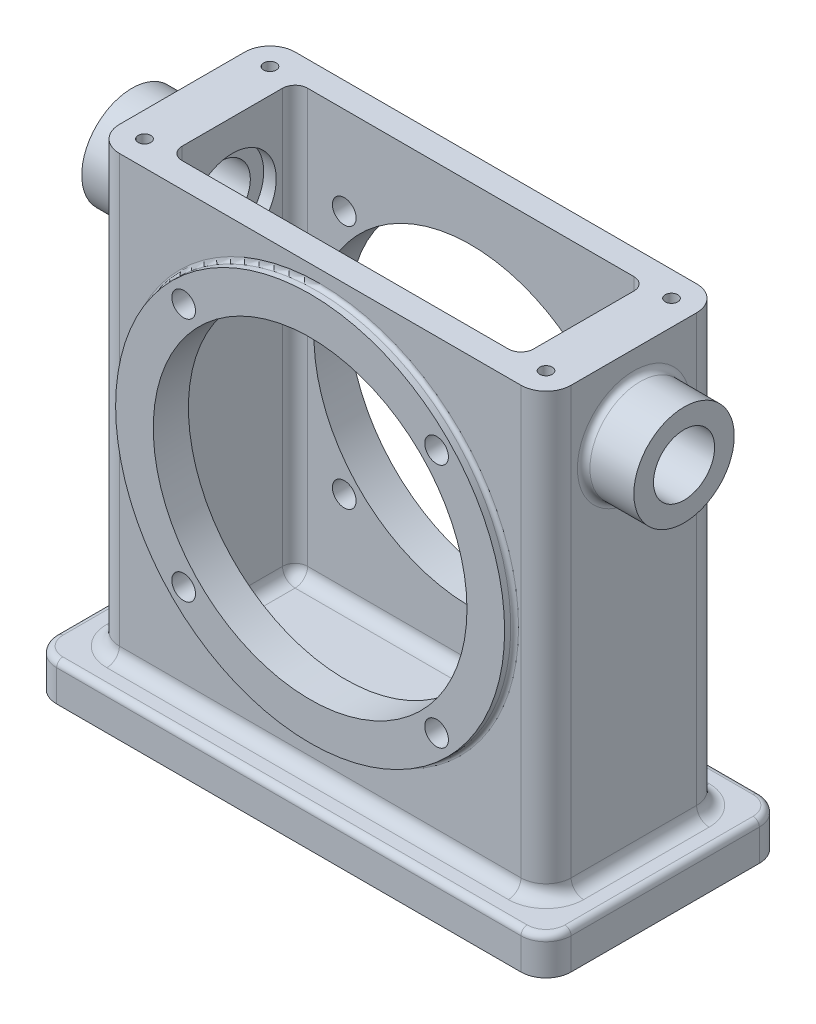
ISO-10303-21;
HEADER;
FILE_DESCRIPTION(('STEP AP214'),'2;1');
FILE_NAME('part.step','',(''),(''),'','','');
FILE_SCHEMA(('AUTOMOTIVE_DESIGN { 1 0 10303 214 1 1 1 1 }'));
ENDSEC;
DATA;
#1=APPLICATION_CONTEXT('core data for automotive mechanical design processes');
#2=APPLICATION_PROTOCOL_DEFINITION('international standard','automotive_design',2000,#1);
#3=PRODUCT_CONTEXT('',#1,'mechanical');
#4=PRODUCT('Part','Part','',(#3));
#5=PRODUCT_RELATED_PRODUCT_CATEGORY('part','',(#4));
#6=PRODUCT_DEFINITION_FORMATION('','',#4);
#7=PRODUCT_DEFINITION_CONTEXT('part definition',#1,'design');
#8=PRODUCT_DEFINITION('design','',#6,#7);
#9=PRODUCT_DEFINITION_SHAPE('','',#8);
#10=(LENGTH_UNIT() NAMED_UNIT(*) SI_UNIT(.MILLI.,.METRE.));
#11=(NAMED_UNIT(*) PLANE_ANGLE_UNIT() SI_UNIT($,.RADIAN.));
#12=(NAMED_UNIT(*) SI_UNIT($,.STERADIAN.) SOLID_ANGLE_UNIT());
#13=UNCERTAINTY_MEASURE_WITH_UNIT(LENGTH_MEASURE(1.E-05),#10,'distance_accuracy_value','');
#14=(GEOMETRIC_REPRESENTATION_CONTEXT(3) GLOBAL_UNCERTAINTY_ASSIGNED_CONTEXT((#13)) GLOBAL_UNIT_ASSIGNED_CONTEXT((#10,
#11,#12)) REPRESENTATION_CONTEXT('',''));
#15=CARTESIAN_POINT('',(0.,0.,0.));
#16=DIRECTION('',(0.,0.,1.));
#17=DIRECTION('',(1.,0.,0.));
#18=AXIS2_PLACEMENT_3D('',#15,#16,#17);
#19=CARTESIAN_POINT('',(-57.15,120.65,22.225));
#20=DIRECTION('',(0.,-1.,0.));
#21=DIRECTION('',(0.,0.,-1.));
#22=AXIS2_PLACEMENT_3D('',#19,#20,#21);
#23=PLANE('',#22);
#24=CARTESIAN_POINT('',(-50.8,120.65,-15.875));
#25=DIRECTION('',(0.,-1.,0.));
#26=DIRECTION('',(0.,0.,1.));
#27=AXIS2_PLACEMENT_3D('',#24,#25,#26);
#28=CIRCLE('',#27,1.5875);
#29=CARTESIAN_POINT('',(-50.8,120.65,-14.2875));
#30=VERTEX_POINT('',#29);
#31=EDGE_CURVE('E1599',#30,#30,#28,.T.);
#32=ORIENTED_EDGE('',*,*,#31,.T.);
#33=EDGE_LOOP('',(#32));
#34=FACE_BOUND('',#33,.T.);
#35=CARTESIAN_POINT('',(50.8,120.65,15.875));
#36=DIRECTION('',(0.,1.,0.));
#37=DIRECTION('',(0.,0.,1.));
#38=AXIS2_PLACEMENT_3D('',#35,#36,#37);
#39=CIRCLE('',#38,1.5875);
#40=CARTESIAN_POINT('',(50.8,120.65,17.4625));
#41=VERTEX_POINT('',#40);
#42=EDGE_CURVE('E1593',#41,#41,#39,.T.);
#43=ORIENTED_EDGE('',*,*,#42,.F.);
#44=EDGE_LOOP('',(#43));
#45=FACE_BOUND('',#44,.T.);
#46=CARTESIAN_POINT('',(50.8,120.65,-15.875));
#47=DIRECTION('',(0.,1.,0.));
#48=DIRECTION('',(0.,0.,1.));
#49=AXIS2_PLACEMENT_3D('',#46,#47,#48);
#50=CIRCLE('',#49,1.5875);
#51=CARTESIAN_POINT('',(50.8,120.65,-14.2875));
#52=VERTEX_POINT('',#51);
#53=EDGE_CURVE('E1587',#52,#52,#50,.T.);
#54=ORIENTED_EDGE('',*,*,#53,.F.);
#55=EDGE_LOOP('',(#54));
#56=FACE_BOUND('',#55,.T.);
#57=DIRECTION('',(0.,0.,-1.));
#58=VECTOR('',#57,1.);
#59=CARTESIAN_POINT('',(44.45,120.65,12.7));
#60=LINE('',#59,#58);
#61=CARTESIAN_POINT('',(44.45,120.65,12.7));
#62=VERTEX_POINT('',#61);
#63=CARTESIAN_POINT('',(44.45,120.65,-12.7));
#64=VERTEX_POINT('',#63);
#65=EDGE_CURVE('E269',#62,#64,#60,.T.);
#66=ORIENTED_EDGE('',*,*,#65,.F.);
#67=CARTESIAN_POINT('',(41.275,120.65,12.7));
#68=DIRECTION('',(0.,1.,0.));
#69=DIRECTION('',(0.,0.,1.));
#70=AXIS2_PLACEMENT_3D('',#67,#68,#69);
#71=CIRCLE('',#70,3.175);
#72=CARTESIAN_POINT('',(41.275,120.65,15.875));
#73=VERTEX_POINT('',#72);
#74=EDGE_CURVE('E274',#73,#62,#71,.T.);
#75=ORIENTED_EDGE('',*,*,#74,.F.);
#76=DIRECTION('',(1.,0.,0.));
#77=VECTOR('',#76,1.);
#78=CARTESIAN_POINT('',(-41.275,120.65,15.875));
#79=LINE('',#78,#77);
#80=CARTESIAN_POINT('',(-41.275,120.65,15.875));
#81=VERTEX_POINT('',#80);
#82=EDGE_CURVE('E293',#81,#73,#79,.T.);
#83=ORIENTED_EDGE('',*,*,#82,.F.);
#84=CARTESIAN_POINT('',(-41.275,120.65,12.7));
#85=DIRECTION('',(0.,1.,0.));
#86=DIRECTION('',(0.,0.,1.));
#87=AXIS2_PLACEMENT_3D('',#84,#85,#86);
#88=CIRCLE('',#87,3.175);
#89=CARTESIAN_POINT('',(-44.45,120.65,12.7));
#90=VERTEX_POINT('',#89);
#91=EDGE_CURVE('E290',#90,#81,#88,.T.);
#92=ORIENTED_EDGE('',*,*,#91,.F.);
#93=DIRECTION('',(0.,0.,1.));
#94=VECTOR('',#93,1.);
#95=CARTESIAN_POINT('',(-44.45,120.65,-12.7));
#96=LINE('',#95,#94);
#97=CARTESIAN_POINT('',(-44.45,120.65,-12.7));
#98=VERTEX_POINT('',#97);
#99=EDGE_CURVE('E287',#98,#90,#96,.T.);
#100=ORIENTED_EDGE('',*,*,#99,.F.);
#101=CARTESIAN_POINT('',(-41.275,120.65,-12.7));
#102=DIRECTION('',(0.,1.,0.));
#103=DIRECTION('',(0.,0.,1.));
#104=AXIS2_PLACEMENT_3D('',#101,#102,#103);
#105=CIRCLE('',#104,3.175);
#106=CARTESIAN_POINT('',(-41.275,120.65,-15.875));
#107=VERTEX_POINT('',#106);
#108=EDGE_CURVE('E281',#107,#98,#105,.T.);
#109=ORIENTED_EDGE('',*,*,#108,.F.);
#110=DIRECTION('',(-1.,0.,0.));
#111=VECTOR('',#110,1.);
#112=CARTESIAN_POINT('',(41.275,120.65,-15.875));
#113=LINE('',#112,#111);
#114=CARTESIAN_POINT('',(41.275,120.65,-15.875));
#115=VERTEX_POINT('',#114);
#116=EDGE_CURVE('E279',#115,#107,#113,.T.);
#117=ORIENTED_EDGE('',*,*,#116,.F.);
#118=CARTESIAN_POINT('',(41.275,120.65,-12.7));
#119=DIRECTION('',(0.,1.,0.));
#120=DIRECTION('',(0.,0.,1.));
#121=AXIS2_PLACEMENT_3D('',#118,#119,#120);
#122=CIRCLE('',#121,3.175);
#123=EDGE_CURVE('E262',#64,#115,#122,.T.);
#124=ORIENTED_EDGE('',*,*,#123,.F.);
#125=EDGE_LOOP('',(#66,#75,#83,#92,#100,#109,#117,#124));
#126=FACE_BOUND('',#125,.T.);
#127=DIRECTION('',(0.,0.,1.));
#128=VECTOR('',#127,1.);
#129=CARTESIAN_POINT('',(-57.15,120.65,22.225));
#130=LINE('',#129,#128);
#131=CARTESIAN_POINT('',(-57.15,120.65,-15.875));
#132=VERTEX_POINT('',#131);
#133=CARTESIAN_POINT('',(-57.15,120.65,15.875));
#134=VERTEX_POINT('',#133);
#135=EDGE_CURVE('E309',#132,#134,#130,.T.);
#136=ORIENTED_EDGE('',*,*,#135,.T.);
#137=CARTESIAN_POINT('',(-50.8,120.65,15.875));
#138=DIRECTION('',(0.,-1.,0.));
#139=DIRECTION('',(0.,0.,-1.));
#140=AXIS2_PLACEMENT_3D('',#137,#138,#139);
#141=CIRCLE('',#140,6.35);
#142=CARTESIAN_POINT('',(-50.8,120.65,22.225));
#143=VERTEX_POINT('',#142);
#144=EDGE_CURVE('E368',#134,#143,#141,.F.);
#145=ORIENTED_EDGE('',*,*,#144,.T.);
#146=DIRECTION('',(1.,0.,0.));
#147=VECTOR('',#146,1.);
#148=CARTESIAN_POINT('',(-57.15,120.65,22.225));
#149=LINE('',#148,#147);
#150=CARTESIAN_POINT('',(50.8,120.65,22.225));
#151=VERTEX_POINT('',#150);
#152=EDGE_CURVE('E312',#143,#151,#149,.T.);
#153=ORIENTED_EDGE('',*,*,#152,.T.);
#154=CARTESIAN_POINT('',(50.8,120.65,15.875));
#155=DIRECTION('',(0.,-1.,0.));
#156=DIRECTION('',(0.,0.,-1.));
#157=AXIS2_PLACEMENT_3D('',#154,#155,#156);
#158=CIRCLE('',#157,6.35);
#159=CARTESIAN_POINT('',(57.15,120.65,15.875));
#160=VERTEX_POINT('',#159);
#161=EDGE_CURVE('E364',#151,#160,#158,.F.);
#162=ORIENTED_EDGE('',*,*,#161,.T.);
#163=DIRECTION('',(0.,0.,-1.));
#164=VECTOR('',#163,1.);
#165=CARTESIAN_POINT('',(57.15,120.65,22.225));
#166=LINE('',#165,#164);
#167=CARTESIAN_POINT('',(57.15,120.65,-15.875));
#168=VERTEX_POINT('',#167);
#169=EDGE_CURVE('E316',#160,#168,#166,.T.);
#170=ORIENTED_EDGE('',*,*,#169,.T.);
#171=CARTESIAN_POINT('',(50.8,120.65,-15.875));
#172=DIRECTION('',(0.,-1.,0.));
#173=DIRECTION('',(0.,0.,-1.));
#174=AXIS2_PLACEMENT_3D('',#171,#172,#173);
#175=CIRCLE('',#174,6.35);
#176=CARTESIAN_POINT('',(50.8,120.65,-22.225));
#177=VERTEX_POINT('',#176);
#178=EDGE_CURVE('E362',#168,#177,#175,.F.);
#179=ORIENTED_EDGE('',*,*,#178,.T.);
#180=DIRECTION('',(-1.,0.,0.));
#181=VECTOR('',#180,1.);
#182=CARTESIAN_POINT('',(-57.15,120.65,-22.225));
#183=LINE('',#182,#181);
#184=CARTESIAN_POINT('',(-50.8,120.65,-22.225));
#185=VERTEX_POINT('',#184);
#186=EDGE_CURVE('E319',#177,#185,#183,.T.);
#187=ORIENTED_EDGE('',*,*,#186,.T.);
#188=CARTESIAN_POINT('',(-50.8,120.65,-15.875));
#189=DIRECTION('',(0.,-1.,0.));
#190=DIRECTION('',(0.,0.,-1.));
#191=AXIS2_PLACEMENT_3D('',#188,#189,#190);
#192=CIRCLE('',#191,6.35);
#193=EDGE_CURVE('E366',#185,#132,#192,.F.);
#194=ORIENTED_EDGE('',*,*,#193,.T.);
#195=EDGE_LOOP('',(#136,#145,#153,#162,#170,#179,#187,#194));
#196=FACE_BOUND('',#195,.T.);
#197=CARTESIAN_POINT('',(-50.8,120.65,15.875));
#198=DIRECTION('',(0.,-1.,0.));
#199=DIRECTION('',(0.,0.,1.));
#200=AXIS2_PLACEMENT_3D('',#197,#198,#199);
#201=CIRCLE('',#200,1.5875);
#202=CARTESIAN_POINT('',(-50.8,120.65,17.4625));
#203=VERTEX_POINT('',#202);
#204=EDGE_CURVE('E1604',#203,#203,#201,.T.);
#205=ORIENTED_EDGE('',*,*,#204,.T.);
#206=EDGE_LOOP('',(#205));
#207=FACE_BOUND('',#206,.T.);
#208=ADVANCED_FACE('F36',(#34,#45,#56,#126,#196,#207),#23,.F.);
#209=CARTESIAN_POINT('',(-44.45,12.7,-12.7));
#210=DIRECTION('',(-1.,0.,0.));
#211=DIRECTION('',(0.,0.,1.));
#212=AXIS2_PLACEMENT_3D('',#209,#210,#211);
#213=PLANE('',#212);
#214=DIRECTION('',(0.,1.,0.));
#215=VECTOR('',#214,1.);
#216=CARTESIAN_POINT('',(-44.45,12.7,12.7));
#217=LINE('',#216,#215);
#218=CARTESIAN_POINT('',(-44.45,15.875,12.7));
#219=VERTEX_POINT('',#218);
#220=EDGE_CURVE('E301',#219,#90,#217,.T.);
#221=ORIENTED_EDGE('',*,*,#220,.F.);
#222=DIRECTION('',(0.,0.,1.));
#223=VECTOR('',#222,1.);
#224=CARTESIAN_POINT('',(-44.45,15.875,-12.7));
#225=LINE('',#224,#223);
#226=CARTESIAN_POINT('',(-44.45,15.875,-12.7));
#227=VERTEX_POINT('',#226);
#228=EDGE_CURVE('E514',#219,#227,#225,.F.);
#229=ORIENTED_EDGE('',*,*,#228,.T.);
#230=DIRECTION('',(0.,1.,0.));
#231=VECTOR('',#230,1.);
#232=CARTESIAN_POINT('',(-44.45,12.7,-12.7));
#233=LINE('',#232,#231);
#234=EDGE_CURVE('E303',#227,#98,#233,.T.);
#235=ORIENTED_EDGE('',*,*,#234,.T.);
#236=ORIENTED_EDGE('',*,*,#99,.T.);
#237=EDGE_LOOP('',(#221,#229,#235,#236));
#238=FACE_BOUND('',#237,.T.);
#239=CARTESIAN_POINT('',(-44.45,101.6,0.));
#240=DIRECTION('',(-1.,0.,0.));
#241=DIRECTION('',(0.,0.,1.));
#242=AXIS2_PLACEMENT_3D('',#239,#240,#241);
#243=CIRCLE('',#242,11.1125);
#244=CARTESIAN_POINT('',(-44.45,101.6,11.1125));
#245=VERTEX_POINT('',#244);
#246=EDGE_CURVE('E626',#245,#245,#243,.T.);
#247=ORIENTED_EDGE('',*,*,#246,.T.);
#248=EDGE_LOOP('',(#247));
#249=FACE_BOUND('',#248,.T.);
#250=ADVANCED_FACE('F674',(#238,#249),#213,.F.);
#251=CARTESIAN_POINT('',(-69.85,101.6,0.));
#252=DIRECTION('',(1.,0.,0.));
#253=DIRECTION('',(0.,0.,-1.));
#254=AXIS2_PLACEMENT_3D('',#251,#252,#253);
#255=CYLINDRICAL_SURFACE('',#254,7.7343);
#256=CARTESIAN_POINT('',(-69.85,101.6,0.));
#257=DIRECTION('',(-1.,0.,0.));
#258=DIRECTION('',(0.,0.,1.));
#259=AXIS2_PLACEMENT_3D('',#256,#257,#258);
#260=CIRCLE('',#259,7.7343);
#261=CARTESIAN_POINT('',(-69.85,101.6,7.73429999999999));
#262=VERTEX_POINT('',#261);
#263=EDGE_CURVE('E573',#262,#262,#260,.T.);
#264=ORIENTED_EDGE('',*,*,#263,.T.);
#265=EDGE_LOOP('',(#264));
#266=FACE_BOUND('',#265,.T.);
#267=CARTESIAN_POINT('',(-47.625,101.6,0.));
#268=DIRECTION('',(1.,0.,0.));
#269=DIRECTION('',(0.,0.,-1.));
#270=AXIS2_PLACEMENT_3D('',#267,#268,#269);
#271=CIRCLE('',#270,7.7343);
#272=CARTESIAN_POINT('',(-47.625,101.6,-7.7343));
#273=VERTEX_POINT('',#272);
#274=EDGE_CURVE('E570',#273,#273,#271,.T.);
#275=ORIENTED_EDGE('',*,*,#274,.T.);
#276=EDGE_LOOP('',(#275));
#277=FACE_BOUND('',#276,.T.);
#278=ADVANCED_FACE('F726',(#266,#277),#255,.F.);
#279=CARTESIAN_POINT('',(-69.85,101.6,0.));
#280=DIRECTION('',(-1.,0.,0.));
#281=DIRECTION('',(0.,0.,-1.));
#282=AXIS2_PLACEMENT_3D('',#279,#280,#281);
#283=PLANE('',#282);
#284=CARTESIAN_POINT('',(-69.85,101.6,0.));
#285=DIRECTION('',(1.,0.,0.));
#286=DIRECTION('',(0.,0.,-1.));
#287=AXIS2_PLACEMENT_3D('',#284,#285,#286);
#288=CIRCLE('',#287,12.7);
#289=CARTESIAN_POINT('',(-69.85,101.6,-12.7));
#290=VERTEX_POINT('',#289);
#291=EDGE_CURVE('E633',#290,#290,#288,.T.);
#292=ORIENTED_EDGE('',*,*,#291,.F.);
#293=EDGE_LOOP('',(#292));
#294=FACE_BOUND('',#293,.T.);
#295=ORIENTED_EDGE('',*,*,#263,.F.);
#296=EDGE_LOOP('',(#295));
#297=FACE_BOUND('',#296,.T.);
#298=ADVANCED_FACE('F1220',(#294,#297),#283,.T.);
#299=CARTESIAN_POINT('',(69.85,101.6,0.));
#300=DIRECTION('',(-1.,0.,0.));
#301=DIRECTION('',(0.,0.,1.));
#302=AXIS2_PLACEMENT_3D('',#299,#300,#301);
#303=CYLINDRICAL_SURFACE('',#302,7.7343);
#304=CARTESIAN_POINT('',(69.85,101.6,0.));
#305=DIRECTION('',(-1.,0.,0.));
#306=DIRECTION('',(0.,0.,1.));
#307=AXIS2_PLACEMENT_3D('',#304,#305,#306);
#308=CIRCLE('',#307,7.7343);
#309=CARTESIAN_POINT('',(69.85,101.6,7.73429999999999));
#310=VERTEX_POINT('',#309);
#311=EDGE_CURVE('E568',#310,#310,#308,.T.);
#312=ORIENTED_EDGE('',*,*,#311,.F.);
#313=EDGE_LOOP('',(#312));
#314=FACE_BOUND('',#313,.T.);
#315=CARTESIAN_POINT('',(47.625,101.6,0.));
#316=DIRECTION('',(-1.,0.,0.));
#317=DIRECTION('',(0.,0.,1.));
#318=AXIS2_PLACEMENT_3D('',#315,#316,#317);
#319=CIRCLE('',#318,7.7343);
#320=CARTESIAN_POINT('',(47.625,101.6,7.73429999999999));
#321=VERTEX_POINT('',#320);
#322=EDGE_CURVE('E565',#321,#321,#319,.F.);
#323=ORIENTED_EDGE('',*,*,#322,.F.);
#324=EDGE_LOOP('',(#323));
#325=FACE_BOUND('',#324,.T.);
#326=ADVANCED_FACE('F743',(#314,#325),#303,.F.);
#327=CARTESIAN_POINT('',(57.15,120.65,22.225));
#328=DIRECTION('',(-1.,0.,0.));
#329=DIRECTION('',(0.,0.,1.));
#330=AXIS2_PLACEMENT_3D('',#327,#328,#329);
#331=PLANE('',#330);
#332=CARTESIAN_POINT('',(57.15,101.6,0.));
#333=DIRECTION('',(-1.,0.,0.));
#334=DIRECTION('',(0.,0.,1.));
#335=AXIS2_PLACEMENT_3D('',#332,#333,#334);
#336=CIRCLE('',#335,14.2875);
#337=CARTESIAN_POINT('',(57.15,101.6,14.2875));
#338=VERTEX_POINT('',#337);
#339=EDGE_CURVE('E11',#338,#338,#336,.T.);
#340=ORIENTED_EDGE('',*,*,#339,.T.);
#341=EDGE_LOOP('',(#340));
#342=FACE_BOUND('',#341,.T.);
#343=DIRECTION('',(0.,-1.,0.));
#344=VECTOR('',#343,1.);
#345=CARTESIAN_POINT('',(57.15,120.65,15.875));
#346=LINE('',#345,#344);
#347=CARTESIAN_POINT('',(57.15,12.7,15.875));
#348=VERTEX_POINT('',#347);
#349=EDGE_CURVE('E377',#160,#348,#346,.T.);
#350=ORIENTED_EDGE('',*,*,#349,.T.);
#351=DIRECTION('',(0.,0.,-1.));
#352=VECTOR('',#351,1.);
#353=CARTESIAN_POINT('',(57.15,12.7,-15.875));
#354=LINE('',#353,#352);
#355=CARTESIAN_POINT('',(57.15,12.7,-15.875));
#356=VERTEX_POINT('',#355);
#357=EDGE_CURVE('E472',#348,#356,#354,.T.);
#358=ORIENTED_EDGE('',*,*,#357,.T.);
#359=DIRECTION('',(0.,-1.,0.));
#360=VECTOR('',#359,1.);
#361=CARTESIAN_POINT('',(57.15,120.65,-15.875));
#362=LINE('',#361,#360);
#363=EDGE_CURVE('E375',#356,#168,#362,.F.);
#364=ORIENTED_EDGE('',*,*,#363,.T.);
#365=ORIENTED_EDGE('',*,*,#169,.F.);
#366=EDGE_LOOP('',(#350,#358,#364,#365));
#367=FACE_BOUND('',#366,.T.);
#368=ADVANCED_FACE('F739',(#342,#367),#331,.F.);
#369=CARTESIAN_POINT('',(-57.15,120.65,22.225));
#370=DIRECTION('',(0.,0.,-1.));
#371=DIRECTION('',(-1.,0.,0.));
#372=AXIS2_PLACEMENT_3D('',#369,#370,#371);
#373=PLANE('',#372);
#374=CARTESIAN_POINT('',(0.,67.31,22.225));
#375=DIRECTION('',(0.,0.,-1.));
#376=DIRECTION('',(-1.,0.,0.));
#377=AXIS2_PLACEMENT_3D('',#374,#375,#376);
#378=CIRCLE('',#377,50.2031);
#379=CARTESIAN_POINT('',(-50.2031,67.31,22.225));
#380=VERTEX_POINT('',#379);
#381=EDGE_CURVE('E555',#380,#380,#378,.T.);
#382=ORIENTED_EDGE('',*,*,#381,.T.);
#383=EDGE_LOOP('',(#382));
#384=FACE_BOUND('',#383,.T.);
#385=DIRECTION('',(0.,-1.,0.));
#386=VECTOR('',#385,1.);
#387=CARTESIAN_POINT('',(-50.8,120.65,22.225));
#388=LINE('',#387,#386);
#389=CARTESIAN_POINT('',(-50.8,12.7,22.225));
#390=VERTEX_POINT('',#389);
#391=EDGE_CURVE('E354',#143,#390,#388,.T.);
#392=ORIENTED_EDGE('',*,*,#391,.T.);
#393=DIRECTION('',(1.,0.,0.));
#394=VECTOR('',#393,1.);
#395=CARTESIAN_POINT('',(50.8,12.7,22.225));
#396=LINE('',#395,#394);
#397=CARTESIAN_POINT('',(50.8,12.7,22.225));
#398=VERTEX_POINT('',#397);
#399=EDGE_CURVE('E478',#390,#398,#396,.T.);
#400=ORIENTED_EDGE('',*,*,#399,.T.);
#401=DIRECTION('',(0.,-1.,0.));
#402=VECTOR('',#401,1.);
#403=CARTESIAN_POINT('',(50.8,120.65,22.225));
#404=LINE('',#403,#402);
#405=EDGE_CURVE('E352',#398,#151,#404,.F.);
#406=ORIENTED_EDGE('',*,*,#405,.T.);
#407=ORIENTED_EDGE('',*,*,#152,.F.);
#408=EDGE_LOOP('',(#392,#400,#406,#407));
#409=FACE_BOUND('',#408,.T.);
#410=ADVANCED_FACE('F742',(#384,#409),#373,.F.);
#411=CARTESIAN_POINT('',(-65.0875,9.525,-30.1625));
#412=DIRECTION('',(0.,-1.,0.));
#413=DIRECTION('',(0.,0.,-1.));
#414=AXIS2_PLACEMENT_3D('',#411,#412,#413);
#415=PLANE('',#414);
#416=CARTESIAN_POINT('',(-50.8,9.525,-15.875));
#417=DIRECTION('',(0.,-1.,0.));
#418=DIRECTION('',(0.,0.,-1.));
#419=AXIS2_PLACEMENT_3D('',#416,#417,#418);
#420=CIRCLE('',#419,9.525);
#421=CARTESIAN_POINT('',(-60.325,9.525,-15.875));
#422=VERTEX_POINT('',#421);
#423=CARTESIAN_POINT('',(-50.8,9.525,-25.4));
#424=VERTEX_POINT('',#423);
#425=EDGE_CURVE('E461',#422,#424,#420,.T.);
#426=ORIENTED_EDGE('',*,*,#425,.T.);
#427=DIRECTION('',(-1.,0.,0.));
#428=VECTOR('',#427,1.);
#429=CARTESIAN_POINT('',(50.8,9.525,-25.4));
#430=LINE('',#429,#428);
#431=CARTESIAN_POINT('',(50.8,9.525,-25.4));
#432=VERTEX_POINT('',#431);
#433=EDGE_CURVE('E463',#424,#432,#430,.F.);
#434=ORIENTED_EDGE('',*,*,#433,.T.);
#435=CARTESIAN_POINT('',(50.8,9.525,-15.875));
#436=DIRECTION('',(0.,-1.,0.));
#437=DIRECTION('',(0.,0.,-1.));
#438=AXIS2_PLACEMENT_3D('',#435,#436,#437);
#439=CIRCLE('',#438,9.525);
#440=CARTESIAN_POINT('',(60.325,9.525,-15.875));
#441=VERTEX_POINT('',#440);
#442=EDGE_CURVE('E459',#432,#441,#439,.T.);
#443=ORIENTED_EDGE('',*,*,#442,.T.);
#444=DIRECTION('',(0.,0.,-1.));
#445=VECTOR('',#444,1.);
#446=CARTESIAN_POINT('',(60.325,9.525,15.875));
#447=LINE('',#446,#445);
#448=CARTESIAN_POINT('',(60.325,9.525,15.875));
#449=VERTEX_POINT('',#448);
#450=EDGE_CURVE('E455',#441,#449,#447,.F.);
#451=ORIENTED_EDGE('',*,*,#450,.T.);
#452=CARTESIAN_POINT('',(50.8,9.525,15.875));
#453=DIRECTION('',(0.,-1.,0.));
#454=DIRECTION('',(0.,0.,-1.));
#455=AXIS2_PLACEMENT_3D('',#452,#453,#454);
#456=CIRCLE('',#455,9.525);
#457=CARTESIAN_POINT('',(50.8,9.525,25.4));
#458=VERTEX_POINT('',#457);
#459=EDGE_CURVE('E451',#449,#458,#456,.T.);
#460=ORIENTED_EDGE('',*,*,#459,.T.);
#461=DIRECTION('',(1.,0.,0.));
#462=VECTOR('',#461,1.);
#463=CARTESIAN_POINT('',(-50.8,9.525,25.4));
#464=LINE('',#463,#462);
#465=CARTESIAN_POINT('',(-50.8,9.525,25.4));
#466=VERTEX_POINT('',#465);
#467=EDGE_CURVE('E449',#458,#466,#464,.F.);
#468=ORIENTED_EDGE('',*,*,#467,.T.);
#469=CARTESIAN_POINT('',(-50.8,9.525,15.875));
#470=DIRECTION('',(0.,-1.,0.));
#471=DIRECTION('',(0.,0.,-1.));
#472=AXIS2_PLACEMENT_3D('',#469,#470,#471);
#473=CIRCLE('',#472,9.525);
#474=CARTESIAN_POINT('',(-60.325,9.525,15.875));
#475=VERTEX_POINT('',#474);
#476=EDGE_CURVE('E453',#466,#475,#473,.T.);
#477=ORIENTED_EDGE('',*,*,#476,.T.);
#478=DIRECTION('',(0.,0.,1.));
#479=VECTOR('',#478,1.);
#480=CARTESIAN_POINT('',(-60.325,9.525,-15.875));
#481=LINE('',#480,#479);
#482=EDGE_CURVE('E457',#475,#422,#481,.F.);
#483=ORIENTED_EDGE('',*,*,#482,.T.);
#484=EDGE_LOOP('',(#426,#434,#443,#451,#460,#468,#477,#483));
#485=FACE_BOUND('',#484,.T.);
#486=CARTESIAN_POINT('',(-58.7375,9.525,23.8125));
#487=DIRECTION('',(0.,-1.,0.));
#488=DIRECTION('',(0.,0.,-1.));
#489=AXIS2_PLACEMENT_3D('',#486,#487,#488);
#490=CIRCLE('',#489,4.7625);
#491=CARTESIAN_POINT('',(-63.5,9.525,23.8125));
#492=VERTEX_POINT('',#491);
#493=CARTESIAN_POINT('',(-58.7375,9.525,28.575));
#494=VERTEX_POINT('',#493);
#495=EDGE_CURVE('E400',#492,#494,#490,.F.);
#496=ORIENTED_EDGE('',*,*,#495,.T.);
#497=DIRECTION('',(1.,0.,0.));
#498=VECTOR('',#497,1.);
#499=CARTESIAN_POINT('',(-65.0875,9.525,28.575));
#500=LINE('',#499,#498);
#501=CARTESIAN_POINT('',(58.7375,9.525,28.575));
#502=VERTEX_POINT('',#501);
#503=EDGE_CURVE('E404',#494,#502,#500,.T.);
#504=ORIENTED_EDGE('',*,*,#503,.T.);
#505=CARTESIAN_POINT('',(58.7375,9.525,23.8125));
#506=DIRECTION('',(0.,-1.,0.));
#507=DIRECTION('',(0.,0.,-1.));
#508=AXIS2_PLACEMENT_3D('',#505,#506,#507);
#509=CIRCLE('',#508,4.7625);
#510=CARTESIAN_POINT('',(63.5,9.525,23.8125));
#511=VERTEX_POINT('',#510);
#512=EDGE_CURVE('E402',#502,#511,#509,.F.);
#513=ORIENTED_EDGE('',*,*,#512,.T.);
#514=DIRECTION('',(0.,0.,-1.));
#515=VECTOR('',#514,1.);
#516=CARTESIAN_POINT('',(63.5,9.525,-30.1625));
#517=LINE('',#516,#515);
#518=CARTESIAN_POINT('',(63.5,9.525,-23.8125));
#519=VERTEX_POINT('',#518);
#520=EDGE_CURVE('E398',#511,#519,#517,.T.);
#521=ORIENTED_EDGE('',*,*,#520,.T.);
#522=CARTESIAN_POINT('',(58.7375,9.525,-23.8125));
#523=DIRECTION('',(0.,-1.,0.));
#524=DIRECTION('',(0.,0.,-1.));
#525=AXIS2_PLACEMENT_3D('',#522,#523,#524);
#526=CIRCLE('',#525,4.7625);
#527=CARTESIAN_POINT('',(58.7375,9.525,-28.575));
#528=VERTEX_POINT('',#527);
#529=EDGE_CURVE('E394',#519,#528,#526,.F.);
#530=ORIENTED_EDGE('',*,*,#529,.T.);
#531=DIRECTION('',(-1.,0.,0.));
#532=VECTOR('',#531,1.);
#533=CARTESIAN_POINT('',(-65.0875,9.525,-28.575));
#534=LINE('',#533,#532);
#535=CARTESIAN_POINT('',(-58.7375,9.525,-28.575));
#536=VERTEX_POINT('',#535);
#537=EDGE_CURVE('E390',#528,#536,#534,.T.);
#538=ORIENTED_EDGE('',*,*,#537,.T.);
#539=CARTESIAN_POINT('',(-58.7375,9.525,-23.8125));
#540=DIRECTION('',(0.,-1.,0.));
#541=DIRECTION('',(0.,0.,-1.));
#542=AXIS2_PLACEMENT_3D('',#539,#540,#541);
#543=CIRCLE('',#542,4.7625);
#544=CARTESIAN_POINT('',(-63.5,9.525,-23.8125));
#545=VERTEX_POINT('',#544);
#546=EDGE_CURVE('E392',#536,#545,#543,.F.);
#547=ORIENTED_EDGE('',*,*,#546,.T.);
#548=DIRECTION('',(0.,0.,1.));
#549=VECTOR('',#548,1.);
#550=CARTESIAN_POINT('',(-63.5,9.525,-30.1625));
#551=LINE('',#550,#549);
#552=EDGE_CURVE('E396',#545,#492,#551,.T.);
#553=ORIENTED_EDGE('',*,*,#552,.T.);
#554=EDGE_LOOP('',(#496,#504,#513,#521,#530,#538,#547,#553));
#555=FACE_BOUND('',#554,.T.);
#556=ADVANCED_FACE('F747',(#485,#555),#415,.F.);
#557=CARTESIAN_POINT('',(-65.0875,9.525,30.1625));
#558=DIRECTION('',(1.,0.,0.));
#559=DIRECTION('',(0.,0.,-1.));
#560=AXIS2_PLACEMENT_3D('',#557,#558,#559);
#561=PLANE('',#560);
#562=DIRECTION('',(0.,-1.,0.));
#563=VECTOR('',#562,1.);
#564=CARTESIAN_POINT('',(-65.0875,9.525,23.8125));
#565=LINE('',#564,#563);
#566=CARTESIAN_POINT('',(-65.0875,0.,23.8125));
#567=VERTEX_POINT('',#566);
#568=CARTESIAN_POINT('',(-65.0875,7.9375,23.8125));
#569=VERTEX_POINT('',#568);
#570=EDGE_CURVE('E349',#567,#569,#565,.F.);
#571=ORIENTED_EDGE('',*,*,#570,.T.);
#572=DIRECTION('',(0.,0.,1.));
#573=VECTOR('',#572,1.);
#574=CARTESIAN_POINT('',(-65.0875,7.9375,30.1625));
#575=LINE('',#574,#573);
#576=CARTESIAN_POINT('',(-65.0875,7.9375,-23.8125));
#577=VERTEX_POINT('',#576);
#578=EDGE_CURVE('E416',#569,#577,#575,.F.);
#579=ORIENTED_EDGE('',*,*,#578,.T.);
#580=DIRECTION('',(0.,-1.,0.));
#581=VECTOR('',#580,1.);
#582=CARTESIAN_POINT('',(-65.0875,9.525,-23.8125));
#583=LINE('',#582,#581);
#584=CARTESIAN_POINT('',(-65.0875,0.,-23.8125));
#585=VERTEX_POINT('',#584);
#586=EDGE_CURVE('E347',#577,#585,#583,.T.);
#587=ORIENTED_EDGE('',*,*,#586,.T.);
#588=DIRECTION('',(0.,0.,1.));
#589=VECTOR('',#588,1.);
#590=CARTESIAN_POINT('',(-65.0875,0.,30.1625));
#591=LINE('',#590,#589);
#592=EDGE_CURVE('E322',#585,#567,#591,.T.);
#593=ORIENTED_EDGE('',*,*,#592,.T.);
#594=EDGE_LOOP('',(#571,#579,#587,#593));
#595=FACE_BOUND('',#594,.T.);
#596=ADVANCED_FACE('F755',(#595),#561,.F.);
#597=CARTESIAN_POINT('',(-65.0875,9.525,30.1625));
#598=DIRECTION('',(0.,0.,-1.));
#599=DIRECTION('',(-1.,0.,0.));
#600=AXIS2_PLACEMENT_3D('',#597,#598,#599);
#601=PLANE('',#600);
#602=DIRECTION('',(0.,-1.,0.));
#603=VECTOR('',#602,1.);
#604=CARTESIAN_POINT('',(58.7375,9.525,30.1625));
#605=LINE('',#604,#603);
#606=CARTESIAN_POINT('',(58.7375,0.,30.1625));
#607=VERTEX_POINT('',#606);
#608=CARTESIAN_POINT('',(58.7375,7.9375,30.1625));
#609=VERTEX_POINT('',#608);
#610=EDGE_CURVE('E334',#607,#609,#605,.F.);
#611=ORIENTED_EDGE('',*,*,#610,.T.);
#612=DIRECTION('',(1.,0.,0.));
#613=VECTOR('',#612,1.);
#614=CARTESIAN_POINT('',(-65.0875,7.9375,30.1625));
#615=LINE('',#614,#613);
#616=CARTESIAN_POINT('',(-58.7375,7.9375,30.1625));
#617=VERTEX_POINT('',#616);
#618=EDGE_CURVE('E407',#609,#617,#615,.F.);
#619=ORIENTED_EDGE('',*,*,#618,.T.);
#620=DIRECTION('',(0.,-1.,0.));
#621=VECTOR('',#620,1.);
#622=CARTESIAN_POINT('',(-58.7375,9.525,30.1625));
#623=LINE('',#622,#621);
#624=CARTESIAN_POINT('',(-58.7375,0.,30.1625));
#625=VERTEX_POINT('',#624);
#626=EDGE_CURVE('E337',#617,#625,#623,.T.);
#627=ORIENTED_EDGE('',*,*,#626,.T.);
#628=DIRECTION('',(1.,0.,0.));
#629=VECTOR('',#628,1.);
#630=CARTESIAN_POINT('',(-65.0875,0.,30.1625));
#631=LINE('',#630,#629);
#632=EDGE_CURVE('E325',#625,#607,#631,.T.);
#633=ORIENTED_EDGE('',*,*,#632,.T.);
#634=EDGE_LOOP('',(#611,#619,#627,#633));
#635=FACE_BOUND('',#634,.T.);
#636=ADVANCED_FACE('F767',(#635),#601,.F.);
#637=CARTESIAN_POINT('',(65.0875,9.525,30.1625));
#638=DIRECTION('',(-1.,0.,0.));
#639=DIRECTION('',(0.,0.,1.));
#640=AXIS2_PLACEMENT_3D('',#637,#638,#639);
#641=PLANE('',#640);
#642=DIRECTION('',(0.,-1.,0.));
#643=VECTOR('',#642,1.);
#644=CARTESIAN_POINT('',(65.0875,9.525,-23.8125));
#645=LINE('',#644,#643);
#646=CARTESIAN_POINT('',(65.0875,0.,-23.8125));
#647=VERTEX_POINT('',#646);
#648=CARTESIAN_POINT('',(65.0875,7.9375,-23.8125));
#649=VERTEX_POINT('',#648);
#650=EDGE_CURVE('E387',#647,#649,#645,.F.);
#651=ORIENTED_EDGE('',*,*,#650,.T.);
#652=DIRECTION('',(0.,0.,-1.));
#653=VECTOR('',#652,1.);
#654=CARTESIAN_POINT('',(65.0875,7.9375,30.1625));
#655=LINE('',#654,#653);
#656=CARTESIAN_POINT('',(65.0875,7.9375,23.8125));
#657=VERTEX_POINT('',#656);
#658=EDGE_CURVE('E414',#649,#657,#655,.F.);
#659=ORIENTED_EDGE('',*,*,#658,.T.);
#660=DIRECTION('',(0.,-1.,0.));
#661=VECTOR('',#660,1.);
#662=CARTESIAN_POINT('',(65.0875,9.525,23.8125));
#663=LINE('',#662,#661);
#664=CARTESIAN_POINT('',(65.0875,0.,23.8125));
#665=VERTEX_POINT('',#664);
#666=EDGE_CURVE('E385',#657,#665,#663,.T.);
#667=ORIENTED_EDGE('',*,*,#666,.T.);
#668=DIRECTION('',(0.,0.,-1.));
#669=VECTOR('',#668,1.);
#670=CARTESIAN_POINT('',(65.0875,0.,30.1625));
#671=LINE('',#670,#669);
#672=EDGE_CURVE('E328',#665,#647,#671,.T.);
#673=ORIENTED_EDGE('',*,*,#672,.T.);
#674=EDGE_LOOP('',(#651,#659,#667,#673));
#675=FACE_BOUND('',#674,.T.);
#676=ADVANCED_FACE('F763',(#675),#641,.F.);
#677=CARTESIAN_POINT('',(-65.0875,9.525,-30.1625));
#678=DIRECTION('',(0.,0.,1.));
#679=DIRECTION('',(1.,0.,0.));
#680=AXIS2_PLACEMENT_3D('',#677,#678,#679);
#681=PLANE('',#680);
#682=DIRECTION('',(0.,-1.,0.));
#683=VECTOR('',#682,1.);
#684=CARTESIAN_POINT('',(-58.7375,9.525,-30.1625));
#685=LINE('',#684,#683);
#686=CARTESIAN_POINT('',(-58.7375,0.,-30.1625));
#687=VERTEX_POINT('',#686);
#688=CARTESIAN_POINT('',(-58.7375,7.9375,-30.1625));
#689=VERTEX_POINT('',#688);
#690=EDGE_CURVE('E380',#687,#689,#685,.F.);
#691=ORIENTED_EDGE('',*,*,#690,.T.);
#692=DIRECTION('',(-1.,0.,0.));
#693=VECTOR('',#692,1.);
#694=CARTESIAN_POINT('',(-65.0875,7.9375,-30.1625));
#695=LINE('',#694,#693);
#696=CARTESIAN_POINT('',(58.7375,7.9375,-30.1625));
#697=VERTEX_POINT('',#696);
#698=EDGE_CURVE('E422',#689,#697,#695,.F.);
#699=ORIENTED_EDGE('',*,*,#698,.T.);
#700=DIRECTION('',(0.,-1.,0.));
#701=VECTOR('',#700,1.);
#702=CARTESIAN_POINT('',(58.7375,9.525,-30.1625));
#703=LINE('',#702,#701);
#704=CARTESIAN_POINT('',(58.7375,0.,-30.1625));
#705=VERTEX_POINT('',#704);
#706=EDGE_CURVE('E383',#697,#705,#703,.T.);
#707=ORIENTED_EDGE('',*,*,#706,.T.);
#708=DIRECTION('',(-1.,0.,0.));
#709=VECTOR('',#708,1.);
#710=CARTESIAN_POINT('',(-65.0875,0.,-30.1625));
#711=LINE('',#710,#709);
#712=EDGE_CURVE('E331',#705,#687,#711,.T.);
#713=ORIENTED_EDGE('',*,*,#712,.T.);
#714=EDGE_LOOP('',(#691,#699,#707,#713));
#715=FACE_BOUND('',#714,.T.);
#716=ADVANCED_FACE('F759',(#715),#681,.F.);
#717=CARTESIAN_POINT('',(-65.0875,0.,-30.1625));
#718=DIRECTION('',(0.,-1.,0.));
#719=DIRECTION('',(0.,0.,-1.));
#720=AXIS2_PLACEMENT_3D('',#717,#718,#719);
#721=PLANE('',#720);
#722=ORIENTED_EDGE('',*,*,#632,.F.);
#723=CARTESIAN_POINT('',(-58.7375,0.,23.8125));
#724=DIRECTION('',(0.,-1.,0.));
#725=DIRECTION('',(0.,0.,-1.));
#726=AXIS2_PLACEMENT_3D('',#723,#724,#725);
#727=CIRCLE('',#726,6.35);
#728=EDGE_CURVE('E345',#625,#567,#727,.T.);
#729=ORIENTED_EDGE('',*,*,#728,.T.);
#730=ORIENTED_EDGE('',*,*,#592,.F.);
#731=CARTESIAN_POINT('',(-58.7375,0.,-23.8125));
#732=DIRECTION('',(0.,-1.,0.));
#733=DIRECTION('',(0.,0.,-1.));
#734=AXIS2_PLACEMENT_3D('',#731,#732,#733);
#735=CIRCLE('',#734,6.35);
#736=EDGE_CURVE('E339',#585,#687,#735,.T.);
#737=ORIENTED_EDGE('',*,*,#736,.T.);
#738=ORIENTED_EDGE('',*,*,#712,.F.);
#739=CARTESIAN_POINT('',(58.7375,0.,-23.8125));
#740=DIRECTION('',(0.,-1.,0.));
#741=DIRECTION('',(0.,0.,-1.));
#742=AXIS2_PLACEMENT_3D('',#739,#740,#741);
#743=CIRCLE('',#742,6.35);
#744=EDGE_CURVE('E343',#705,#647,#743,.T.);
#745=ORIENTED_EDGE('',*,*,#744,.T.);
#746=ORIENTED_EDGE('',*,*,#672,.F.);
#747=CARTESIAN_POINT('',(58.7375,0.,23.8125));
#748=DIRECTION('',(0.,-1.,0.));
#749=DIRECTION('',(0.,0.,-1.));
#750=AXIS2_PLACEMENT_3D('',#747,#748,#749);
#751=CIRCLE('',#750,6.35);
#752=EDGE_CURVE('E341',#665,#607,#751,.T.);
#753=ORIENTED_EDGE('',*,*,#752,.T.);
#754=EDGE_LOOP('',(#722,#729,#730,#737,#738,#745,#746,#753));
#755=FACE_BOUND('',#754,.T.);
#756=ADVANCED_FACE('F751',(#755),#721,.T.);
#757=CARTESIAN_POINT('',(-57.15,120.65,22.225));
#758=DIRECTION('',(1.,0.,0.));
#759=DIRECTION('',(0.,0.,-1.));
#760=AXIS2_PLACEMENT_3D('',#757,#758,#759);
#761=PLANE('',#760);
#762=CARTESIAN_POINT('',(-57.15,101.6,0.));
#763=DIRECTION('',(1.,0.,0.));
#764=DIRECTION('',(0.,0.,-1.));
#765=AXIS2_PLACEMENT_3D('',#762,#763,#764);
#766=CIRCLE('',#765,14.2875);
#767=CARTESIAN_POINT('',(-57.15,101.6,-14.2875));
#768=VERTEX_POINT('',#767);
#769=EDGE_CURVE('E564',#768,#768,#766,.T.);
#770=ORIENTED_EDGE('',*,*,#769,.T.);
#771=EDGE_LOOP('',(#770));
#772=FACE_BOUND('',#771,.T.);
#773=DIRECTION('',(0.,-1.,0.));
#774=VECTOR('',#773,1.);
#775=CARTESIAN_POINT('',(-57.15,120.65,-15.875));
#776=LINE('',#775,#774);
#777=CARTESIAN_POINT('',(-57.15,12.7,-15.875));
#778=VERTEX_POINT('',#777);
#779=EDGE_CURVE('E357',#132,#778,#776,.T.);
#780=ORIENTED_EDGE('',*,*,#779,.T.);
#781=DIRECTION('',(0.,0.,1.));
#782=VECTOR('',#781,1.);
#783=CARTESIAN_POINT('',(-57.15,12.7,15.875));
#784=LINE('',#783,#782);
#785=CARTESIAN_POINT('',(-57.15,12.7,15.875));
#786=VERTEX_POINT('',#785);
#787=EDGE_CURVE('E470',#778,#786,#784,.T.);
#788=ORIENTED_EDGE('',*,*,#787,.T.);
#789=DIRECTION('',(0.,-1.,0.));
#790=VECTOR('',#789,1.);
#791=CARTESIAN_POINT('',(-57.15,120.65,15.875));
#792=LINE('',#791,#790);
#793=EDGE_CURVE('E360',#786,#134,#792,.F.);
#794=ORIENTED_EDGE('',*,*,#793,.T.);
#795=ORIENTED_EDGE('',*,*,#135,.F.);
#796=EDGE_LOOP('',(#780,#788,#794,#795));
#797=FACE_BOUND('',#796,.T.);
#798=ADVANCED_FACE('F737',(#772,#797),#761,.F.);
#799=CARTESIAN_POINT('',(-57.15,120.65,-22.225));
#800=DIRECTION('',(0.,0.,1.));
#801=DIRECTION('',(1.,0.,0.));
#802=AXIS2_PLACEMENT_3D('',#799,#800,#801);
#803=PLANE('',#802);
#804=CARTESIAN_POINT('',(0.,67.31,-22.225));
#805=DIRECTION('',(0.,0.,1.));
#806=DIRECTION('',(1.,0.,0.));
#807=AXIS2_PLACEMENT_3D('',#804,#805,#806);
#808=CIRCLE('',#807,50.2031);
#809=CARTESIAN_POINT('',(50.2031,67.31,-22.225));
#810=VERTEX_POINT('',#809);
#811=EDGE_CURVE('E558',#810,#810,#808,.T.);
#812=ORIENTED_EDGE('',*,*,#811,.T.);
#813=EDGE_LOOP('',(#812));
#814=FACE_BOUND('',#813,.T.);
#815=DIRECTION('',(0.,-1.,0.));
#816=VECTOR('',#815,1.);
#817=CARTESIAN_POINT('',(50.8,120.65,-22.225));
#818=LINE('',#817,#816);
#819=CARTESIAN_POINT('',(50.8,12.7,-22.225));
#820=VERTEX_POINT('',#819);
#821=EDGE_CURVE('E370',#177,#820,#818,.T.);
#822=ORIENTED_EDGE('',*,*,#821,.T.);
#823=DIRECTION('',(-1.,0.,0.));
#824=VECTOR('',#823,1.);
#825=CARTESIAN_POINT('',(-50.8,12.7,-22.225));
#826=LINE('',#825,#824);
#827=CARTESIAN_POINT('',(-50.8,12.7,-22.225));
#828=VERTEX_POINT('',#827);
#829=EDGE_CURVE('E424',#820,#828,#826,.T.);
#830=ORIENTED_EDGE('',*,*,#829,.T.);
#831=DIRECTION('',(0.,-1.,0.));
#832=VECTOR('',#831,1.);
#833=CARTESIAN_POINT('',(-50.8,120.65,-22.225));
#834=LINE('',#833,#832);
#835=EDGE_CURVE('E373',#828,#185,#834,.F.);
#836=ORIENTED_EDGE('',*,*,#835,.T.);
#837=ORIENTED_EDGE('',*,*,#186,.F.);
#838=EDGE_LOOP('',(#822,#830,#836,#837));
#839=FACE_BOUND('',#838,.T.);
#840=ADVANCED_FACE('F733',(#814,#839),#803,.F.);
#841=CARTESIAN_POINT('',(-58.7375,9.525,23.8125));
#842=DIRECTION('',(0.,-1.,0.));
#843=DIRECTION('',(0.,0.,-1.));
#844=AXIS2_PLACEMENT_3D('',#841,#842,#843);
#845=CYLINDRICAL_SURFACE('',#844,6.35);
#846=ORIENTED_EDGE('',*,*,#626,.F.);
#847=CARTESIAN_POINT('',(-58.7375,7.9375,23.8125));
#848=DIRECTION('',(0.,-1.,0.));
#849=DIRECTION('',(0.,0.,-1.));
#850=AXIS2_PLACEMENT_3D('',#847,#848,#849);
#851=CIRCLE('',#850,6.35);
#852=EDGE_CURVE('E412',#617,#569,#851,.T.);
#853=ORIENTED_EDGE('',*,*,#852,.T.);
#854=ORIENTED_EDGE('',*,*,#570,.F.);
#855=ORIENTED_EDGE('',*,*,#728,.F.);
#856=EDGE_LOOP('',(#846,#853,#854,#855));
#857=FACE_BOUND('',#856,.T.);
#858=ADVANCED_FACE('F736',(#857),#845,.T.);
#859=CARTESIAN_POINT('',(-50.8,120.65,15.875));
#860=DIRECTION('',(0.,-1.,0.));
#861=DIRECTION('',(0.,0.,-1.));
#862=AXIS2_PLACEMENT_3D('',#859,#860,#861);
#863=CYLINDRICAL_SURFACE('',#862,6.35);
#864=ORIENTED_EDGE('',*,*,#793,.F.);
#865=CARTESIAN_POINT('',(-50.8,12.7,15.875));
#866=DIRECTION('',(0.,-1.,0.));
#867=DIRECTION('',(0.,0.,-1.));
#868=AXIS2_PLACEMENT_3D('',#865,#866,#867);
#869=CIRCLE('',#868,6.35);
#870=EDGE_CURVE('E474',#786,#390,#869,.F.);
#871=ORIENTED_EDGE('',*,*,#870,.T.);
#872=ORIENTED_EDGE('',*,*,#391,.F.);
#873=ORIENTED_EDGE('',*,*,#144,.F.);
#874=EDGE_LOOP('',(#864,#871,#872,#873));
#875=FACE_BOUND('',#874,.T.);
#876=ADVANCED_FACE('F777',(#875),#863,.T.);
#877=CARTESIAN_POINT('',(-50.8,120.65,-15.875));
#878=DIRECTION('',(0.,-1.,0.));
#879=DIRECTION('',(0.,0.,-1.));
#880=AXIS2_PLACEMENT_3D('',#877,#878,#879);
#881=CYLINDRICAL_SURFACE('',#880,6.35);
#882=ORIENTED_EDGE('',*,*,#835,.F.);
#883=CARTESIAN_POINT('',(-50.8,12.7,-15.875));
#884=DIRECTION('',(0.,-1.,0.));
#885=DIRECTION('',(0.,0.,-1.));
#886=AXIS2_PLACEMENT_3D('',#883,#884,#885);
#887=CIRCLE('',#886,6.35);
#888=EDGE_CURVE('E466',#828,#778,#887,.F.);
#889=ORIENTED_EDGE('',*,*,#888,.T.);
#890=ORIENTED_EDGE('',*,*,#779,.F.);
#891=ORIENTED_EDGE('',*,*,#193,.F.);
#892=EDGE_LOOP('',(#882,#889,#890,#891));
#893=FACE_BOUND('',#892,.T.);
#894=ADVANCED_FACE('F781',(#893),#881,.T.);
#895=CARTESIAN_POINT('',(50.8,120.65,15.875));
#896=DIRECTION('',(0.,-1.,0.));
#897=DIRECTION('',(0.,0.,-1.));
#898=AXIS2_PLACEMENT_3D('',#895,#896,#897);
#899=CYLINDRICAL_SURFACE('',#898,6.35);
#900=ORIENTED_EDGE('',*,*,#405,.F.);
#901=CARTESIAN_POINT('',(50.8,12.7,15.875));
#902=DIRECTION('',(0.,-1.,0.));
#903=DIRECTION('',(0.,0.,-1.));
#904=AXIS2_PLACEMENT_3D('',#901,#902,#903);
#905=CIRCLE('',#904,6.35);
#906=EDGE_CURVE('E476',#398,#348,#905,.F.);
#907=ORIENTED_EDGE('',*,*,#906,.T.);
#908=ORIENTED_EDGE('',*,*,#349,.F.);
#909=ORIENTED_EDGE('',*,*,#161,.F.);
#910=EDGE_LOOP('',(#900,#907,#908,#909));
#911=FACE_BOUND('',#910,.T.);
#912=ADVANCED_FACE('F785',(#911),#899,.T.);
#913=CARTESIAN_POINT('',(50.8,120.65,-15.875));
#914=DIRECTION('',(0.,-1.,0.));
#915=DIRECTION('',(0.,0.,-1.));
#916=AXIS2_PLACEMENT_3D('',#913,#914,#915);
#917=CYLINDRICAL_SURFACE('',#916,6.35);
#918=ORIENTED_EDGE('',*,*,#363,.F.);
#919=CARTESIAN_POINT('',(50.8,12.7,-15.875));
#920=DIRECTION('',(0.,-1.,0.));
#921=DIRECTION('',(0.,0.,-1.));
#922=AXIS2_PLACEMENT_3D('',#919,#920,#921);
#923=CIRCLE('',#922,6.35);
#924=EDGE_CURVE('E468',#356,#820,#923,.F.);
#925=ORIENTED_EDGE('',*,*,#924,.T.);
#926=ORIENTED_EDGE('',*,*,#821,.F.);
#927=ORIENTED_EDGE('',*,*,#178,.F.);
#928=EDGE_LOOP('',(#918,#925,#926,#927));
#929=FACE_BOUND('',#928,.T.);
#930=ADVANCED_FACE('F789',(#929),#917,.T.);
#931=CARTESIAN_POINT('',(58.7375,9.525,-23.8125));
#932=DIRECTION('',(0.,-1.,0.));
#933=DIRECTION('',(0.,0.,-1.));
#934=AXIS2_PLACEMENT_3D('',#931,#932,#933);
#935=CYLINDRICAL_SURFACE('',#934,6.35);
#936=ORIENTED_EDGE('',*,*,#706,.F.);
#937=CARTESIAN_POINT('',(58.7375,7.9375,-23.8125));
#938=DIRECTION('',(0.,-1.,0.));
#939=DIRECTION('',(0.,0.,-1.));
#940=AXIS2_PLACEMENT_3D('',#937,#938,#939);
#941=CIRCLE('',#940,6.35);
#942=EDGE_CURVE('E418',#697,#649,#941,.T.);
#943=ORIENTED_EDGE('',*,*,#942,.T.);
#944=ORIENTED_EDGE('',*,*,#650,.F.);
#945=ORIENTED_EDGE('',*,*,#744,.F.);
#946=EDGE_LOOP('',(#936,#943,#944,#945));
#947=FACE_BOUND('',#946,.T.);
#948=ADVANCED_FACE('F793',(#947),#935,.T.);
#949=CARTESIAN_POINT('',(58.7375,9.525,23.8125));
#950=DIRECTION('',(0.,-1.,0.));
#951=DIRECTION('',(0.,0.,-1.));
#952=AXIS2_PLACEMENT_3D('',#949,#950,#951);
#953=CYLINDRICAL_SURFACE('',#952,6.35);
#954=ORIENTED_EDGE('',*,*,#666,.F.);
#955=CARTESIAN_POINT('',(58.7375,7.9375,23.8125));
#956=DIRECTION('',(0.,-1.,0.));
#957=DIRECTION('',(0.,0.,-1.));
#958=AXIS2_PLACEMENT_3D('',#955,#956,#957);
#959=CIRCLE('',#958,6.35);
#960=EDGE_CURVE('E410',#657,#609,#959,.T.);
#961=ORIENTED_EDGE('',*,*,#960,.T.);
#962=ORIENTED_EDGE('',*,*,#610,.F.);
#963=ORIENTED_EDGE('',*,*,#752,.F.);
#964=EDGE_LOOP('',(#954,#961,#962,#963));
#965=FACE_BOUND('',#964,.T.);
#966=ADVANCED_FACE('F797',(#965),#953,.T.);
#967=CARTESIAN_POINT('',(-58.7375,9.525,-23.8125));
#968=DIRECTION('',(0.,-1.,0.));
#969=DIRECTION('',(0.,0.,-1.));
#970=AXIS2_PLACEMENT_3D('',#967,#968,#969);
#971=CYLINDRICAL_SURFACE('',#970,6.35);
#972=ORIENTED_EDGE('',*,*,#586,.F.);
#973=CARTESIAN_POINT('',(-58.7375,7.9375,-23.8125));
#974=DIRECTION('',(0.,-1.,0.));
#975=DIRECTION('',(0.,0.,-1.));
#976=AXIS2_PLACEMENT_3D('',#973,#974,#975);
#977=CIRCLE('',#976,6.35);
#978=EDGE_CURVE('E420',#577,#689,#977,.T.);
#979=ORIENTED_EDGE('',*,*,#978,.T.);
#980=ORIENTED_EDGE('',*,*,#690,.F.);
#981=ORIENTED_EDGE('',*,*,#736,.F.);
#982=EDGE_LOOP('',(#972,#979,#980,#981));
#983=FACE_BOUND('',#982,.T.);
#984=ADVANCED_FACE('F801',(#983),#971,.T.);
#985=CARTESIAN_POINT('',(-65.0875,7.9375,-28.575));
#986=DIRECTION('',(-1.,0.,0.));
#987=DIRECTION('',(0.,0.,1.));
#988=AXIS2_PLACEMENT_3D('',#985,#986,#987);
#989=CYLINDRICAL_SURFACE('',#988,1.5875);
#990=CARTESIAN_POINT('',(58.7375,7.9375,-28.575));
#991=DIRECTION('',(1.,0.,0.));
#992=DIRECTION('',(0.,0.,-1.));
#993=AXIS2_PLACEMENT_3D('',#990,#991,#992);
#994=CIRCLE('',#993,1.5875);
#995=EDGE_CURVE('E442',#697,#528,#994,.T.);
#996=ORIENTED_EDGE('',*,*,#995,.F.);
#997=ORIENTED_EDGE('',*,*,#698,.F.);
#998=CARTESIAN_POINT('',(-58.7375,7.9375,-28.575));
#999=DIRECTION('',(-1.,0.,0.));
#1000=DIRECTION('',(0.,0.,1.));
#1001=AXIS2_PLACEMENT_3D('',#998,#999,#1000);
#1002=CIRCLE('',#1001,1.5875);
#1003=EDGE_CURVE('E313',#536,#689,#1002,.T.);
#1004=ORIENTED_EDGE('',*,*,#1003,.F.);
#1005=ORIENTED_EDGE('',*,*,#537,.F.);
#1006=EDGE_LOOP('',(#996,#997,#1004,#1005));
#1007=FACE_BOUND('',#1006,.T.);
#1008=ADVANCED_FACE('F805',(#1007),#989,.T.);
#1009=CARTESIAN_POINT('',(-58.7375,7.9375,-23.8125));
#1010=DIRECTION('',(0.,-1.,0.));
#1011=DIRECTION('',(0.,0.,-1.));
#1012=AXIS2_PLACEMENT_3D('',#1009,#1010,#1011);
#1013=TOROIDAL_SURFACE('',#1012,4.7625,1.5875);
#1014=ORIENTED_EDGE('',*,*,#1003,.T.);
#1015=ORIENTED_EDGE('',*,*,#978,.F.);
#1016=CARTESIAN_POINT('',(-63.5,7.9375,-23.8125));
#1017=DIRECTION('',(0.,0.,1.));
#1018=DIRECTION('',(1.,0.,0.));
#1019=AXIS2_PLACEMENT_3D('',#1016,#1017,#1018);
#1020=CIRCLE('',#1019,1.5875);
#1021=EDGE_CURVE('E439',#545,#577,#1020,.T.);
#1022=ORIENTED_EDGE('',*,*,#1021,.F.);
#1023=ORIENTED_EDGE('',*,*,#546,.F.);
#1024=EDGE_LOOP('',(#1014,#1015,#1022,#1023));
#1025=FACE_BOUND('',#1024,.T.);
#1026=ADVANCED_FACE('F831',(#1025),#1013,.T.);
#1027=CARTESIAN_POINT('',(58.7375,7.9375,-23.8125));
#1028=DIRECTION('',(0.,-1.,0.));
#1029=DIRECTION('',(0.,0.,-1.));
#1030=AXIS2_PLACEMENT_3D('',#1027,#1028,#1029);
#1031=TOROIDAL_SURFACE('',#1030,4.7625,1.5875);
#1032=ORIENTED_EDGE('',*,*,#995,.T.);
#1033=ORIENTED_EDGE('',*,*,#529,.F.);
#1034=CARTESIAN_POINT('',(63.5,7.9375,-23.8125));
#1035=DIRECTION('',(0.,0.,1.));
#1036=DIRECTION('',(1.,0.,0.));
#1037=AXIS2_PLACEMENT_3D('',#1034,#1035,#1036);
#1038=CIRCLE('',#1037,1.5875);
#1039=EDGE_CURVE('E436',#649,#519,#1038,.T.);
#1040=ORIENTED_EDGE('',*,*,#1039,.F.);
#1041=ORIENTED_EDGE('',*,*,#942,.F.);
#1042=EDGE_LOOP('',(#1032,#1033,#1040,#1041));
#1043=FACE_BOUND('',#1042,.T.);
#1044=ADVANCED_FACE('F827',(#1043),#1031,.T.);
#1045=CARTESIAN_POINT('',(-63.5,7.9375,-30.1625));
#1046=DIRECTION('',(0.,0.,1.));
#1047=DIRECTION('',(1.,0.,0.));
#1048=AXIS2_PLACEMENT_3D('',#1045,#1046,#1047);
#1049=CYLINDRICAL_SURFACE('',#1048,1.5875);
#1050=ORIENTED_EDGE('',*,*,#1021,.T.);
#1051=ORIENTED_EDGE('',*,*,#578,.F.);
#1052=CARTESIAN_POINT('',(-63.5,7.9375,23.8125));
#1053=DIRECTION('',(0.,0.,1.));
#1054=DIRECTION('',(1.,0.,0.));
#1055=AXIS2_PLACEMENT_3D('',#1052,#1053,#1054);
#1056=CIRCLE('',#1055,1.5875);
#1057=EDGE_CURVE('E433',#492,#569,#1056,.T.);
#1058=ORIENTED_EDGE('',*,*,#1057,.F.);
#1059=ORIENTED_EDGE('',*,*,#552,.F.);
#1060=EDGE_LOOP('',(#1050,#1051,#1058,#1059));
#1061=FACE_BOUND('',#1060,.T.);
#1062=ADVANCED_FACE('F823',(#1061),#1049,.T.);
#1063=CARTESIAN_POINT('',(63.5,7.9375,-30.1625));
#1064=DIRECTION('',(0.,0.,-1.));
#1065=DIRECTION('',(-1.,0.,0.));
#1066=AXIS2_PLACEMENT_3D('',#1063,#1064,#1065);
#1067=CYLINDRICAL_SURFACE('',#1066,1.5875);
#1068=ORIENTED_EDGE('',*,*,#1039,.T.);
#1069=ORIENTED_EDGE('',*,*,#520,.F.);
#1070=CARTESIAN_POINT('',(63.5,7.9375,23.8125));
#1071=DIRECTION('',(0.,0.,1.));
#1072=DIRECTION('',(1.,0.,0.));
#1073=AXIS2_PLACEMENT_3D('',#1070,#1071,#1072);
#1074=CIRCLE('',#1073,1.5875);
#1075=EDGE_CURVE('E430',#657,#511,#1074,.T.);
#1076=ORIENTED_EDGE('',*,*,#1075,.F.);
#1077=ORIENTED_EDGE('',*,*,#658,.F.);
#1078=EDGE_LOOP('',(#1068,#1069,#1076,#1077));
#1079=FACE_BOUND('',#1078,.T.);
#1080=ADVANCED_FACE('F819',(#1079),#1067,.T.);
#1081=CARTESIAN_POINT('',(-58.7375,7.9375,23.8125));
#1082=DIRECTION('',(0.,-1.,0.));
#1083=DIRECTION('',(0.,0.,-1.));
#1084=AXIS2_PLACEMENT_3D('',#1081,#1082,#1083);
#1085=TOROIDAL_SURFACE('',#1084,4.7625,1.5875);
#1086=ORIENTED_EDGE('',*,*,#1057,.T.);
#1087=ORIENTED_EDGE('',*,*,#852,.F.);
#1088=CARTESIAN_POINT('',(-58.7375,7.9375,28.575));
#1089=DIRECTION('',(1.,0.,0.));
#1090=DIRECTION('',(0.,0.,-1.));
#1091=AXIS2_PLACEMENT_3D('',#1088,#1089,#1090);
#1092=CIRCLE('',#1091,1.5875);
#1093=EDGE_CURVE('E427',#494,#617,#1092,.T.);
#1094=ORIENTED_EDGE('',*,*,#1093,.F.);
#1095=ORIENTED_EDGE('',*,*,#495,.F.);
#1096=EDGE_LOOP('',(#1086,#1087,#1094,#1095));
#1097=FACE_BOUND('',#1096,.T.);
#1098=ADVANCED_FACE('F815',(#1097),#1085,.T.);
#1099=CARTESIAN_POINT('',(58.7375,7.9375,23.8125));
#1100=DIRECTION('',(0.,-1.,0.));
#1101=DIRECTION('',(0.,0.,-1.));
#1102=AXIS2_PLACEMENT_3D('',#1099,#1100,#1101);
#1103=TOROIDAL_SURFACE('',#1102,4.7625,1.5875);
#1104=ORIENTED_EDGE('',*,*,#1075,.T.);
#1105=ORIENTED_EDGE('',*,*,#512,.F.);
#1106=CARTESIAN_POINT('',(58.7375,7.9375,28.575));
#1107=DIRECTION('',(-1.,0.,0.));
#1108=DIRECTION('',(0.,0.,1.));
#1109=AXIS2_PLACEMENT_3D('',#1106,#1107,#1108);
#1110=CIRCLE('',#1109,1.5875);
#1111=EDGE_CURVE('E425',#609,#502,#1110,.T.);
#1112=ORIENTED_EDGE('',*,*,#1111,.F.);
#1113=ORIENTED_EDGE('',*,*,#960,.F.);
#1114=EDGE_LOOP('',(#1104,#1105,#1112,#1113));
#1115=FACE_BOUND('',#1114,.T.);
#1116=ADVANCED_FACE('F811',(#1115),#1103,.T.);
#1117=CARTESIAN_POINT('',(-65.0875,7.9375,28.575));
#1118=DIRECTION('',(1.,0.,0.));
#1119=DIRECTION('',(0.,0.,-1.));
#1120=AXIS2_PLACEMENT_3D('',#1117,#1118,#1119);
#1121=CYLINDRICAL_SURFACE('',#1120,1.5875);
#1122=ORIENTED_EDGE('',*,*,#1093,.T.);
#1123=ORIENTED_EDGE('',*,*,#618,.F.);
#1124=ORIENTED_EDGE('',*,*,#1111,.T.);
#1125=ORIENTED_EDGE('',*,*,#503,.F.);
#1126=EDGE_LOOP('',(#1122,#1123,#1124,#1125));
#1127=FACE_BOUND('',#1126,.T.);
#1128=ADVANCED_FACE('F807',(#1127),#1121,.T.);
#1129=CARTESIAN_POINT('',(-57.15,12.7,25.4));
#1130=DIRECTION('',(-1.,0.,0.));
#1131=DIRECTION('',(0.,0.,1.));
#1132=AXIS2_PLACEMENT_3D('',#1129,#1130,#1131);
#1133=CYLINDRICAL_SURFACE('',#1132,3.175);
#1134=CARTESIAN_POINT('',(-50.8,12.7,25.4));
#1135=DIRECTION('',(1.,0.,0.));
#1136=DIRECTION('',(0.,0.,-1.));
#1137=AXIS2_PLACEMENT_3D('',#1134,#1135,#1136);
#1138=CIRCLE('',#1137,3.175);
#1139=EDGE_CURVE('E496',#466,#390,#1138,.T.);
#1140=ORIENTED_EDGE('',*,*,#1139,.F.);
#1141=ORIENTED_EDGE('',*,*,#467,.F.);
#1142=CARTESIAN_POINT('',(50.8,12.7,25.4));
#1143=DIRECTION('',(-1.,0.,0.));
#1144=DIRECTION('',(0.,0.,1.));
#1145=AXIS2_PLACEMENT_3D('',#1142,#1143,#1144);
#1146=CIRCLE('',#1145,3.175);
#1147=EDGE_CURVE('E428',#398,#458,#1146,.T.);
#1148=ORIENTED_EDGE('',*,*,#1147,.F.);
#1149=ORIENTED_EDGE('',*,*,#399,.F.);
#1150=EDGE_LOOP('',(#1140,#1141,#1148,#1149));
#1151=FACE_BOUND('',#1150,.T.);
#1152=ADVANCED_FACE('F810',(#1151),#1133,.F.);
#1153=CARTESIAN_POINT('',(50.8,12.7,15.875));
#1154=DIRECTION('',(0.,-1.,0.));
#1155=DIRECTION('',(0.,0.,-1.));
#1156=AXIS2_PLACEMENT_3D('',#1153,#1154,#1155);
#1157=TOROIDAL_SURFACE('',#1156,9.525,3.175);
#1158=ORIENTED_EDGE('',*,*,#1147,.T.);
#1159=ORIENTED_EDGE('',*,*,#459,.F.);
#1160=CARTESIAN_POINT('',(60.325,12.7,15.875));
#1161=DIRECTION('',(0.,0.,1.));
#1162=DIRECTION('',(1.,0.,0.));
#1163=AXIS2_PLACEMENT_3D('',#1160,#1161,#1162);
#1164=CIRCLE('',#1163,3.175);
#1165=EDGE_CURVE('E493',#348,#449,#1164,.T.);
#1166=ORIENTED_EDGE('',*,*,#1165,.F.);
#1167=ORIENTED_EDGE('',*,*,#906,.F.);
#1168=EDGE_LOOP('',(#1158,#1159,#1166,#1167));
#1169=FACE_BOUND('',#1168,.T.);
#1170=ADVANCED_FACE('F862',(#1169),#1157,.F.);
#1171=CARTESIAN_POINT('',(-50.8,12.7,15.875));
#1172=DIRECTION('',(0.,-1.,0.));
#1173=DIRECTION('',(0.,0.,-1.));
#1174=AXIS2_PLACEMENT_3D('',#1171,#1172,#1173);
#1175=TOROIDAL_SURFACE('',#1174,9.525,3.175);
#1176=ORIENTED_EDGE('',*,*,#1139,.T.);
#1177=ORIENTED_EDGE('',*,*,#870,.F.);
#1178=CARTESIAN_POINT('',(-60.325,12.7,15.875));
#1179=DIRECTION('',(0.,0.,1.));
#1180=DIRECTION('',(1.,0.,0.));
#1181=AXIS2_PLACEMENT_3D('',#1178,#1179,#1180);
#1182=CIRCLE('',#1181,3.175);
#1183=EDGE_CURVE('E490',#475,#786,#1182,.T.);
#1184=ORIENTED_EDGE('',*,*,#1183,.F.);
#1185=ORIENTED_EDGE('',*,*,#476,.F.);
#1186=EDGE_LOOP('',(#1176,#1177,#1184,#1185));
#1187=FACE_BOUND('',#1186,.T.);
#1188=ADVANCED_FACE('F858',(#1187),#1175,.F.);
#1189=CARTESIAN_POINT('',(60.325,12.7,22.225));
#1190=DIRECTION('',(0.,0.,1.));
#1191=DIRECTION('',(1.,0.,0.));
#1192=AXIS2_PLACEMENT_3D('',#1189,#1190,#1191);
#1193=CYLINDRICAL_SURFACE('',#1192,3.175);
#1194=ORIENTED_EDGE('',*,*,#1165,.T.);
#1195=ORIENTED_EDGE('',*,*,#450,.F.);
#1196=CARTESIAN_POINT('',(60.325,12.7,-15.875));
#1197=DIRECTION('',(0.,0.,1.));
#1198=DIRECTION('',(1.,0.,0.));
#1199=AXIS2_PLACEMENT_3D('',#1196,#1197,#1198);
#1200=CIRCLE('',#1199,3.175);
#1201=EDGE_CURVE('E487',#356,#441,#1200,.T.);
#1202=ORIENTED_EDGE('',*,*,#1201,.F.);
#1203=ORIENTED_EDGE('',*,*,#357,.F.);
#1204=EDGE_LOOP('',(#1194,#1195,#1202,#1203));
#1205=FACE_BOUND('',#1204,.T.);
#1206=ADVANCED_FACE('F854',(#1205),#1193,.F.);
#1207=CARTESIAN_POINT('',(-60.325,12.7,22.225));
#1208=DIRECTION('',(0.,0.,-1.));
#1209=DIRECTION('',(-1.,0.,0.));
#1210=AXIS2_PLACEMENT_3D('',#1207,#1208,#1209);
#1211=CYLINDRICAL_SURFACE('',#1210,3.175);
#1212=ORIENTED_EDGE('',*,*,#1183,.T.);
#1213=ORIENTED_EDGE('',*,*,#787,.F.);
#1214=CARTESIAN_POINT('',(-60.325,12.7,-15.875));
#1215=DIRECTION('',(0.,0.,1.));
#1216=DIRECTION('',(1.,0.,0.));
#1217=AXIS2_PLACEMENT_3D('',#1214,#1215,#1216);
#1218=CIRCLE('',#1217,3.175);
#1219=EDGE_CURVE('E484',#422,#778,#1218,.T.);
#1220=ORIENTED_EDGE('',*,*,#1219,.F.);
#1221=ORIENTED_EDGE('',*,*,#482,.F.);
#1222=EDGE_LOOP('',(#1212,#1213,#1220,#1221));
#1223=FACE_BOUND('',#1222,.T.);
#1224=ADVANCED_FACE('F850',(#1223),#1211,.F.);
#1225=CARTESIAN_POINT('',(50.8,12.7,-15.875));
#1226=DIRECTION('',(0.,-1.,0.));
#1227=DIRECTION('',(0.,0.,-1.));
#1228=AXIS2_PLACEMENT_3D('',#1225,#1226,#1227);
#1229=TOROIDAL_SURFACE('',#1228,9.525,3.175);
#1230=ORIENTED_EDGE('',*,*,#1201,.T.);
#1231=ORIENTED_EDGE('',*,*,#442,.F.);
#1232=CARTESIAN_POINT('',(50.8,12.7,-25.4));
#1233=DIRECTION('',(1.,0.,0.));
#1234=DIRECTION('',(0.,0.,-1.));
#1235=AXIS2_PLACEMENT_3D('',#1232,#1233,#1234);
#1236=CIRCLE('',#1235,3.175);
#1237=EDGE_CURVE('E482',#820,#432,#1236,.T.);
#1238=ORIENTED_EDGE('',*,*,#1237,.F.);
#1239=ORIENTED_EDGE('',*,*,#924,.F.);
#1240=EDGE_LOOP('',(#1230,#1231,#1238,#1239));
#1241=FACE_BOUND('',#1240,.T.);
#1242=ADVANCED_FACE('F846',(#1241),#1229,.F.);
#1243=CARTESIAN_POINT('',(-50.8,12.7,-15.875));
#1244=DIRECTION('',(0.,-1.,0.));
#1245=DIRECTION('',(0.,0.,-1.));
#1246=AXIS2_PLACEMENT_3D('',#1243,#1244,#1245);
#1247=TOROIDAL_SURFACE('',#1246,9.525,3.175);
#1248=ORIENTED_EDGE('',*,*,#1219,.T.);
#1249=ORIENTED_EDGE('',*,*,#888,.F.);
#1250=CARTESIAN_POINT('',(-50.8,12.7,-25.4));
#1251=DIRECTION('',(-1.,0.,0.));
#1252=DIRECTION('',(0.,0.,1.));
#1253=AXIS2_PLACEMENT_3D('',#1250,#1251,#1252);
#1254=CIRCLE('',#1253,3.175);
#1255=EDGE_CURVE('E298',#424,#828,#1254,.T.);
#1256=ORIENTED_EDGE('',*,*,#1255,.F.);
#1257=ORIENTED_EDGE('',*,*,#425,.F.);
#1258=EDGE_LOOP('',(#1248,#1249,#1256,#1257));
#1259=FACE_BOUND('',#1258,.T.);
#1260=ADVANCED_FACE('F842',(#1259),#1247,.F.);
#1261=CARTESIAN_POINT('',(-57.15,12.7,-25.4));
#1262=DIRECTION('',(1.,0.,0.));
#1263=DIRECTION('',(0.,0.,-1.));
#1264=AXIS2_PLACEMENT_3D('',#1261,#1262,#1263);
#1265=CYLINDRICAL_SURFACE('',#1264,3.175);
#1266=ORIENTED_EDGE('',*,*,#1237,.T.);
#1267=ORIENTED_EDGE('',*,*,#433,.F.);
#1268=ORIENTED_EDGE('',*,*,#1255,.T.);
#1269=ORIENTED_EDGE('',*,*,#829,.F.);
#1270=EDGE_LOOP('',(#1266,#1267,#1268,#1269));
#1271=FACE_BOUND('',#1270,.T.);
#1272=ADVANCED_FACE('F839',(#1271),#1265,.F.);
#1273=CARTESIAN_POINT('',(41.275,12.7,12.7));
#1274=DIRECTION('',(0.,1.,0.));
#1275=DIRECTION('',(0.,0.,1.));
#1276=AXIS2_PLACEMENT_3D('',#1273,#1274,#1275);
#1277=CYLINDRICAL_SURFACE('',#1276,3.175);
#1278=DIRECTION('',(0.,1.,0.));
#1279=VECTOR('',#1278,1.);
#1280=CARTESIAN_POINT('',(44.45,12.7,12.7));
#1281=LINE('',#1280,#1279);
#1282=CARTESIAN_POINT('',(44.45,15.875,12.7));
#1283=VERTEX_POINT('',#1282);
#1284=EDGE_CURVE('E266',#1283,#62,#1281,.T.);
#1285=ORIENTED_EDGE('',*,*,#1284,.F.);
#1286=CARTESIAN_POINT('',(41.275,15.875,12.7));
#1287=DIRECTION('',(0.,1.,0.));
#1288=DIRECTION('',(0.,0.,1.));
#1289=AXIS2_PLACEMENT_3D('',#1286,#1287,#1288);
#1290=CIRCLE('',#1289,3.175);
#1291=CARTESIAN_POINT('',(41.275,15.875,15.875));
#1292=VERTEX_POINT('',#1291);
#1293=EDGE_CURVE('E522',#1283,#1292,#1290,.F.);
#1294=ORIENTED_EDGE('',*,*,#1293,.T.);
#1295=DIRECTION('',(0.,1.,0.));
#1296=VECTOR('',#1295,1.);
#1297=CARTESIAN_POINT('',(41.275,12.7,15.875));
#1298=LINE('',#1297,#1296);
#1299=EDGE_CURVE('E296',#1292,#73,#1298,.T.);
#1300=ORIENTED_EDGE('',*,*,#1299,.T.);
#1301=ORIENTED_EDGE('',*,*,#74,.T.);
#1302=EDGE_LOOP('',(#1285,#1294,#1300,#1301));
#1303=FACE_BOUND('',#1302,.T.);
#1304=ADVANCED_FACE('F658',(#1303),#1277,.F.);
#1305=CARTESIAN_POINT('',(-41.275,12.7,15.875));
#1306=DIRECTION('',(0.,0.,1.));
#1307=DIRECTION('',(1.,0.,0.));
#1308=AXIS2_PLACEMENT_3D('',#1305,#1306,#1307);
#1309=PLANE('',#1308);
#1310=CARTESIAN_POINT('',(32.,98.31,15.875));
#1311=DIRECTION('',(0.,0.,1.));
#1312=DIRECTION('',(1.,0.,0.));
#1313=AXIS2_PLACEMENT_3D('',#1310,#1311,#1312);
#1314=CIRCLE('',#1313,2.99999999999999);
#1315=CARTESIAN_POINT('',(35.,98.31,15.875));
#1316=VERTEX_POINT('',#1315);
#1317=EDGE_CURVE('E606',#1316,#1316,#1314,.T.);
#1318=ORIENTED_EDGE('',*,*,#1317,.T.);
#1319=EDGE_LOOP('',(#1318));
#1320=FACE_BOUND('',#1319,.T.);
#1321=CARTESIAN_POINT('',(-32.,98.31,15.875));
#1322=DIRECTION('',(0.,0.,1.));
#1323=DIRECTION('',(1.,0.,0.));
#1324=AXIS2_PLACEMENT_3D('',#1321,#1322,#1323);
#1325=CIRCLE('',#1324,2.99999999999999);
#1326=CARTESIAN_POINT('',(-29.,98.31,15.875));
#1327=VERTEX_POINT('',#1326);
#1328=EDGE_CURVE('E593',#1327,#1327,#1325,.T.);
#1329=ORIENTED_EDGE('',*,*,#1328,.T.);
#1330=EDGE_LOOP('',(#1329));
#1331=FACE_BOUND('',#1330,.T.);
#1332=CARTESIAN_POINT('',(-32.,36.31,15.875));
#1333=DIRECTION('',(0.,0.,1.));
#1334=DIRECTION('',(1.,0.,0.));
#1335=AXIS2_PLACEMENT_3D('',#1332,#1333,#1334);
#1336=CIRCLE('',#1335,2.99999999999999);
#1337=CARTESIAN_POINT('',(-29.,36.31,15.875));
#1338=VERTEX_POINT('',#1337);
#1339=EDGE_CURVE('E589',#1338,#1338,#1336,.T.);
#1340=ORIENTED_EDGE('',*,*,#1339,.T.);
#1341=EDGE_LOOP('',(#1340));
#1342=FACE_BOUND('',#1341,.T.);
#1343=CARTESIAN_POINT('',(32.,36.31,15.875));
#1344=DIRECTION('',(0.,0.,1.));
#1345=DIRECTION('',(1.,0.,0.));
#1346=AXIS2_PLACEMENT_3D('',#1343,#1344,#1345);
#1347=CIRCLE('',#1346,2.99999999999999);
#1348=CARTESIAN_POINT('',(35.,36.31,15.875));
#1349=VERTEX_POINT('',#1348);
#1350=EDGE_CURVE('E585',#1349,#1349,#1347,.T.);
#1351=ORIENTED_EDGE('',*,*,#1350,.T.);
#1352=EDGE_LOOP('',(#1351));
#1353=FACE_BOUND('',#1352,.T.);
#1354=CARTESIAN_POINT('',(0.,67.31,15.875));
#1355=DIRECTION('',(0.,0.,1.));
#1356=DIRECTION('',(1.,0.,0.));
#1357=AXIS2_PLACEMENT_3D('',#1354,#1355,#1356);
#1358=CIRCLE('',#1357,39.6875);
#1359=CARTESIAN_POINT('',(39.6875,67.31,15.875));
#1360=VERTEX_POINT('',#1359);
#1361=EDGE_CURVE('E650',#1360,#1360,#1358,.T.);
#1362=ORIENTED_EDGE('',*,*,#1361,.T.);
#1363=EDGE_LOOP('',(#1362));
#1364=FACE_BOUND('',#1363,.T.);
#1365=ORIENTED_EDGE('',*,*,#1299,.F.);
#1366=DIRECTION('',(1.,0.,0.));
#1367=VECTOR('',#1366,1.);
#1368=CARTESIAN_POINT('',(-41.275,15.875,15.875));
#1369=LINE('',#1368,#1367);
#1370=CARTESIAN_POINT('',(-41.275,15.875,15.875));
#1371=VERTEX_POINT('',#1370);
#1372=EDGE_CURVE('E509',#1292,#1371,#1369,.F.);
#1373=ORIENTED_EDGE('',*,*,#1372,.T.);
#1374=DIRECTION('',(0.,1.,0.));
#1375=VECTOR('',#1374,1.);
#1376=CARTESIAN_POINT('',(-41.275,12.7,15.875));
#1377=LINE('',#1376,#1375);
#1378=EDGE_CURVE('E299',#1371,#81,#1377,.T.);
#1379=ORIENTED_EDGE('',*,*,#1378,.T.);
#1380=ORIENTED_EDGE('',*,*,#82,.T.);
#1381=EDGE_LOOP('',(#1365,#1373,#1379,#1380));
#1382=FACE_BOUND('',#1381,.T.);
#1383=ADVANCED_FACE('F665',(#1320,#1331,#1342,#1353,#1364,#1382),#1309,.F.);
#1384=CARTESIAN_POINT('',(-41.275,12.7,12.7));
#1385=DIRECTION('',(0.,1.,0.));
#1386=DIRECTION('',(0.,0.,1.));
#1387=AXIS2_PLACEMENT_3D('',#1384,#1385,#1386);
#1388=CYLINDRICAL_SURFACE('',#1387,3.175);
#1389=ORIENTED_EDGE('',*,*,#1378,.F.);
#1390=CARTESIAN_POINT('',(-41.275,15.875,12.7));
#1391=DIRECTION('',(0.,1.,0.));
#1392=DIRECTION('',(0.,0.,1.));
#1393=AXIS2_PLACEMENT_3D('',#1390,#1391,#1392);
#1394=CIRCLE('',#1393,3.175);
#1395=EDGE_CURVE('E512',#1371,#219,#1394,.F.);
#1396=ORIENTED_EDGE('',*,*,#1395,.T.);
#1397=ORIENTED_EDGE('',*,*,#220,.T.);
#1398=ORIENTED_EDGE('',*,*,#91,.T.);
#1399=EDGE_LOOP('',(#1389,#1396,#1397,#1398));
#1400=FACE_BOUND('',#1399,.T.);
#1401=ADVANCED_FACE('F669',(#1400),#1388,.F.);
#1402=CARTESIAN_POINT('',(-41.275,12.7,-12.7));
#1403=DIRECTION('',(0.,1.,0.));
#1404=DIRECTION('',(0.,0.,1.));
#1405=AXIS2_PLACEMENT_3D('',#1402,#1403,#1404);
#1406=CYLINDRICAL_SURFACE('',#1405,3.175);
#1407=ORIENTED_EDGE('',*,*,#234,.F.);
#1408=CARTESIAN_POINT('',(-41.275,15.875,-12.7));
#1409=DIRECTION('',(0.,1.,0.));
#1410=DIRECTION('',(0.,0.,1.));
#1411=AXIS2_PLACEMENT_3D('',#1408,#1409,#1410);
#1412=CIRCLE('',#1411,3.175);
#1413=CARTESIAN_POINT('',(-41.275,15.875,-15.875));
#1414=VERTEX_POINT('',#1413);
#1415=EDGE_CURVE('E516',#227,#1414,#1412,.F.);
#1416=ORIENTED_EDGE('',*,*,#1415,.T.);
#1417=DIRECTION('',(0.,1.,0.));
#1418=VECTOR('',#1417,1.);
#1419=CARTESIAN_POINT('',(-41.275,12.7,-15.875));
#1420=LINE('',#1419,#1418);
#1421=EDGE_CURVE('E305',#1414,#107,#1420,.T.);
#1422=ORIENTED_EDGE('',*,*,#1421,.T.);
#1423=ORIENTED_EDGE('',*,*,#108,.T.);
#1424=EDGE_LOOP('',(#1407,#1416,#1422,#1423));
#1425=FACE_BOUND('',#1424,.T.);
#1426=ADVANCED_FACE('F678',(#1425),#1406,.F.);
#1427=CARTESIAN_POINT('',(41.275,12.7,-15.875));
#1428=DIRECTION('',(0.,0.,-1.));
#1429=DIRECTION('',(-1.,0.,0.));
#1430=AXIS2_PLACEMENT_3D('',#1427,#1428,#1429);
#1431=PLANE('',#1430);
#1432=CARTESIAN_POINT('',(32.,98.31,-15.875));
#1433=DIRECTION('',(0.,0.,-1.));
#1434=DIRECTION('',(-1.,0.,0.));
#1435=AXIS2_PLACEMENT_3D('',#1432,#1433,#1434);
#1436=CIRCLE('',#1435,2.99999999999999);
#1437=CARTESIAN_POINT('',(29.,98.31,-15.875));
#1438=VERTEX_POINT('',#1437);
#1439=EDGE_CURVE('E601',#1438,#1438,#1436,.T.);
#1440=ORIENTED_EDGE('',*,*,#1439,.T.);
#1441=EDGE_LOOP('',(#1440));
#1442=FACE_BOUND('',#1441,.T.);
#1443=CARTESIAN_POINT('',(-32.,98.31,-15.875));
#1444=DIRECTION('',(0.,0.,-1.));
#1445=DIRECTION('',(-1.,0.,0.));
#1446=AXIS2_PLACEMENT_3D('',#1443,#1444,#1445);
#1447=CIRCLE('',#1446,2.99999999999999);
#1448=CARTESIAN_POINT('',(-35.,98.31,-15.875));
#1449=VERTEX_POINT('',#1448);
#1450=EDGE_CURVE('E591',#1449,#1449,#1447,.T.);
#1451=ORIENTED_EDGE('',*,*,#1450,.T.);
#1452=EDGE_LOOP('',(#1451));
#1453=FACE_BOUND('',#1452,.T.);
#1454=CARTESIAN_POINT('',(-32.,36.31,-15.875));
#1455=DIRECTION('',(0.,0.,-1.));
#1456=DIRECTION('',(-1.,0.,0.));
#1457=AXIS2_PLACEMENT_3D('',#1454,#1455,#1456);
#1458=CIRCLE('',#1457,2.99999999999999);
#1459=CARTESIAN_POINT('',(-35.,36.31,-15.875));
#1460=VERTEX_POINT('',#1459);
#1461=EDGE_CURVE('E587',#1460,#1460,#1458,.T.);
#1462=ORIENTED_EDGE('',*,*,#1461,.T.);
#1463=EDGE_LOOP('',(#1462));
#1464=FACE_BOUND('',#1463,.T.);
#1465=CARTESIAN_POINT('',(32.,36.31,-15.875));
#1466=DIRECTION('',(0.,0.,-1.));
#1467=DIRECTION('',(-1.,0.,0.));
#1468=AXIS2_PLACEMENT_3D('',#1465,#1466,#1467);
#1469=CIRCLE('',#1468,2.99999999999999);
#1470=CARTESIAN_POINT('',(29.,36.31,-15.875));
#1471=VERTEX_POINT('',#1470);
#1472=EDGE_CURVE('E623',#1471,#1471,#1469,.T.);
#1473=ORIENTED_EDGE('',*,*,#1472,.T.);
#1474=EDGE_LOOP('',(#1473));
#1475=FACE_BOUND('',#1474,.T.);
#1476=CARTESIAN_POINT('',(0.,67.31,-15.875));
#1477=DIRECTION('',(0.,0.,-1.));
#1478=DIRECTION('',(-1.,0.,0.));
#1479=AXIS2_PLACEMENT_3D('',#1476,#1477,#1478);
#1480=CIRCLE('',#1479,39.6875);
#1481=CARTESIAN_POINT('',(39.6875,67.31,-15.875));
#1482=VERTEX_POINT('',#1481);
#1483=EDGE_CURVE('E551',#1482,#1482,#1480,.T.);
#1484=ORIENTED_EDGE('',*,*,#1483,.T.);
#1485=EDGE_LOOP('',(#1484));
#1486=FACE_BOUND('',#1485,.T.);
#1487=ORIENTED_EDGE('',*,*,#1421,.F.);
#1488=DIRECTION('',(-1.,0.,0.));
#1489=VECTOR('',#1488,1.);
#1490=CARTESIAN_POINT('',(41.275,15.875,-15.875));
#1491=LINE('',#1490,#1489);
#1492=CARTESIAN_POINT('',(41.275,15.875,-15.875));
#1493=VERTEX_POINT('',#1492);
#1494=EDGE_CURVE('E518',#1414,#1493,#1491,.F.);
#1495=ORIENTED_EDGE('',*,*,#1494,.T.);
#1496=DIRECTION('',(0.,1.,0.));
#1497=VECTOR('',#1496,1.);
#1498=CARTESIAN_POINT('',(41.275,12.7,-15.875));
#1499=LINE('',#1498,#1497);
#1500=EDGE_CURVE('E265',#1493,#115,#1499,.T.);
#1501=ORIENTED_EDGE('',*,*,#1500,.T.);
#1502=ORIENTED_EDGE('',*,*,#116,.T.);
#1503=EDGE_LOOP('',(#1487,#1495,#1501,#1502));
#1504=FACE_BOUND('',#1503,.T.);
#1505=ADVANCED_FACE('F683',(#1442,#1453,#1464,#1475,#1486,#1504),#1431,.F.);
#1506=CARTESIAN_POINT('',(41.275,12.7,-12.7));
#1507=DIRECTION('',(0.,1.,0.));
#1508=DIRECTION('',(0.,0.,1.));
#1509=AXIS2_PLACEMENT_3D('',#1506,#1507,#1508);
#1510=CYLINDRICAL_SURFACE('',#1509,3.175);
#1511=ORIENTED_EDGE('',*,*,#1500,.F.);
#1512=CARTESIAN_POINT('',(41.275,15.875,-12.7));
#1513=DIRECTION('',(0.,1.,0.));
#1514=DIRECTION('',(0.,0.,1.));
#1515=AXIS2_PLACEMENT_3D('',#1512,#1513,#1514);
#1516=CIRCLE('',#1515,3.175);
#1517=CARTESIAN_POINT('',(44.45,15.875,-12.7));
#1518=VERTEX_POINT('',#1517);
#1519=EDGE_CURVE('E61',#1493,#1518,#1516,.F.);
#1520=ORIENTED_EDGE('',*,*,#1519,.T.);
#1521=DIRECTION('',(0.,1.,0.));
#1522=VECTOR('',#1521,1.);
#1523=CARTESIAN_POINT('',(44.45,12.7,-12.7));
#1524=LINE('',#1523,#1522);
#1525=EDGE_CURVE('E258',#1518,#64,#1524,.T.);
#1526=ORIENTED_EDGE('',*,*,#1525,.T.);
#1527=ORIENTED_EDGE('',*,*,#123,.T.);
#1528=EDGE_LOOP('',(#1511,#1520,#1526,#1527));
#1529=FACE_BOUND('',#1528,.T.);
#1530=ADVANCED_FACE('F260',(#1529),#1510,.F.);
#1531=CARTESIAN_POINT('',(44.45,12.7,12.7));
#1532=DIRECTION('',(1.,0.,0.));
#1533=DIRECTION('',(0.,0.,-1.));
#1534=AXIS2_PLACEMENT_3D('',#1531,#1532,#1533);
#1535=PLANE('',#1534);
#1536=CARTESIAN_POINT('',(44.45,101.6,0.));
#1537=DIRECTION('',(-1.,0.,0.));
#1538=DIRECTION('',(0.,0.,1.));
#1539=AXIS2_PLACEMENT_3D('',#1536,#1537,#1538);
#1540=CIRCLE('',#1539,11.1125);
#1541=CARTESIAN_POINT('',(44.45,101.6,11.1125));
#1542=VERTEX_POINT('',#1541);
#1543=EDGE_CURVE('E636',#1542,#1542,#1540,.T.);
#1544=ORIENTED_EDGE('',*,*,#1543,.F.);
#1545=EDGE_LOOP('',(#1544));
#1546=FACE_BOUND('',#1545,.T.);
#1547=ORIENTED_EDGE('',*,*,#1525,.F.);
#1548=DIRECTION('',(0.,0.,-1.));
#1549=VECTOR('',#1548,1.);
#1550=CARTESIAN_POINT('',(44.45,15.875,12.7));
#1551=LINE('',#1550,#1549);
#1552=EDGE_CURVE('E53',#1518,#1283,#1551,.F.);
#1553=ORIENTED_EDGE('',*,*,#1552,.T.);
#1554=ORIENTED_EDGE('',*,*,#1284,.T.);
#1555=ORIENTED_EDGE('',*,*,#65,.T.);
#1556=EDGE_LOOP('',(#1547,#1553,#1554,#1555));
#1557=FACE_BOUND('',#1556,.T.);
#1558=ADVANCED_FACE('F270',(#1546,#1557),#1535,.F.);
#1559=CARTESIAN_POINT('',(41.275,12.7,12.7));
#1560=DIRECTION('',(0.,1.,0.));
#1561=DIRECTION('',(0.,0.,1.));
#1562=AXIS2_PLACEMENT_3D('',#1559,#1560,#1561);
#1563=PLANE('',#1562);
#1564=DIRECTION('',(0.,0.,1.));
#1565=VECTOR('',#1564,1.);
#1566=CARTESIAN_POINT('',(-41.275,12.7,12.7));
#1567=LINE('',#1566,#1565);
#1568=CARTESIAN_POINT('',(-41.275,12.7,-12.7));
#1569=VERTEX_POINT('',#1568);
#1570=CARTESIAN_POINT('',(-41.275,12.7,12.7));
#1571=VERTEX_POINT('',#1570);
#1572=EDGE_CURVE('E504',#1569,#1571,#1567,.T.);
#1573=ORIENTED_EDGE('',*,*,#1572,.T.);
#1574=DIRECTION('',(1.,0.,0.));
#1575=VECTOR('',#1574,1.);
#1576=CARTESIAN_POINT('',(41.275,12.7,12.7));
#1577=LINE('',#1576,#1575);
#1578=CARTESIAN_POINT('',(41.275,12.7,12.7));
#1579=VERTEX_POINT('',#1578);
#1580=EDGE_CURVE('E506',#1571,#1579,#1577,.T.);
#1581=ORIENTED_EDGE('',*,*,#1580,.T.);
#1582=DIRECTION('',(0.,0.,-1.));
#1583=VECTOR('',#1582,1.);
#1584=CARTESIAN_POINT('',(41.275,12.7,12.7));
#1585=LINE('',#1584,#1583);
#1586=CARTESIAN_POINT('',(41.275,12.7,-12.7));
#1587=VERTEX_POINT('',#1586);
#1588=EDGE_CURVE('E480',#1579,#1587,#1585,.T.);
#1589=ORIENTED_EDGE('',*,*,#1588,.T.);
#1590=DIRECTION('',(-1.,0.,0.));
#1591=VECTOR('',#1590,1.);
#1592=CARTESIAN_POINT('',(41.275,12.7,-12.7));
#1593=LINE('',#1592,#1591);
#1594=EDGE_CURVE('E502',#1587,#1569,#1593,.T.);
#1595=ORIENTED_EDGE('',*,*,#1594,.T.);
#1596=EDGE_LOOP('',(#1573,#1581,#1589,#1595));
#1597=FACE_BOUND('',#1596,.T.);
#1598=ADVANCED_FACE('F718',(#1597),#1563,.T.);
#1599=CARTESIAN_POINT('',(41.275,15.875,-12.7));
#1600=DIRECTION('',(-1.,0.,0.));
#1601=DIRECTION('',(0.,0.,1.));
#1602=AXIS2_PLACEMENT_3D('',#1599,#1600,#1601);
#1603=CYLINDRICAL_SURFACE('',#1602,3.175);
#1604=CARTESIAN_POINT('',(41.275,15.875,-12.7));
#1605=DIRECTION('',(-1.,0.,0.));
#1606=DIRECTION('',(0.,0.,1.));
#1607=AXIS2_PLACEMENT_3D('',#1604,#1605,#1606);
#1608=CIRCLE('',#1607,3.175);
#1609=EDGE_CURVE('E542',#1493,#1587,#1608,.T.);
#1610=ORIENTED_EDGE('',*,*,#1609,.F.);
#1611=ORIENTED_EDGE('',*,*,#1494,.F.);
#1612=CARTESIAN_POINT('',(-41.275,15.875,-12.7));
#1613=DIRECTION('',(1.,0.,0.));
#1614=DIRECTION('',(0.,0.,-1.));
#1615=AXIS2_PLACEMENT_3D('',#1612,#1613,#1614);
#1616=CIRCLE('',#1615,3.175);
#1617=EDGE_CURVE('E545',#1569,#1414,#1616,.T.);
#1618=ORIENTED_EDGE('',*,*,#1617,.F.);
#1619=ORIENTED_EDGE('',*,*,#1594,.F.);
#1620=EDGE_LOOP('',(#1610,#1611,#1618,#1619));
#1621=FACE_BOUND('',#1620,.T.);
#1622=ADVANCED_FACE('F687',(#1621),#1603,.F.);
#1623=CARTESIAN_POINT('',(-41.275,15.875,-12.7));
#1624=DIRECTION('',(0.,0.,1.));
#1625=DIRECTION('',(1.,0.,0.));
#1626=AXIS2_PLACEMENT_3D('',#1623,#1624,#1625);
#1627=SPHERICAL_SURFACE('',#1626,3.175);
#1628=ORIENTED_EDGE('',*,*,#1617,.T.);
#1629=ORIENTED_EDGE('',*,*,#1415,.F.);
#1630=CARTESIAN_POINT('',(-41.275,15.875,-12.7));
#1631=DIRECTION('',(0.,0.,-1.));
#1632=DIRECTION('',(-1.,0.,0.));
#1633=AXIS2_PLACEMENT_3D('',#1630,#1631,#1632);
#1634=CIRCLE('',#1633,3.175);
#1635=EDGE_CURVE('E539',#1569,#227,#1634,.T.);
#1636=ORIENTED_EDGE('',*,*,#1635,.F.);
#1637=EDGE_LOOP('',(#1628,#1629,#1636));
#1638=FACE_BOUND('',#1637,.T.);
#1639=ADVANCED_FACE('F710',(#1638),#1627,.F.);
#1640=CARTESIAN_POINT('',(41.275,15.875,-12.7));
#1641=DIRECTION('',(0.,0.,1.));
#1642=DIRECTION('',(1.,0.,0.));
#1643=AXIS2_PLACEMENT_3D('',#1640,#1641,#1642);
#1644=SPHERICAL_SURFACE('',#1643,3.175);
#1645=ORIENTED_EDGE('',*,*,#1519,.F.);
#1646=ORIENTED_EDGE('',*,*,#1609,.T.);
#1647=CARTESIAN_POINT('',(41.275,15.875,-12.7));
#1648=DIRECTION('',(0.,0.,-1.));
#1649=DIRECTION('',(-1.,0.,0.));
#1650=AXIS2_PLACEMENT_3D('',#1647,#1648,#1649);
#1651=CIRCLE('',#1650,3.175);
#1652=EDGE_CURVE('E536',#1518,#1587,#1651,.T.);
#1653=ORIENTED_EDGE('',*,*,#1652,.F.);
#1654=EDGE_LOOP('',(#1645,#1646,#1653));
#1655=FACE_BOUND('',#1654,.T.);
#1656=ADVANCED_FACE('F690',(#1655),#1644,.F.);
#1657=CARTESIAN_POINT('',(-41.275,15.875,12.7));
#1658=DIRECTION('',(0.,0.,1.));
#1659=DIRECTION('',(1.,0.,0.));
#1660=AXIS2_PLACEMENT_3D('',#1657,#1658,#1659);
#1661=CYLINDRICAL_SURFACE('',#1660,3.175);
#1662=ORIENTED_EDGE('',*,*,#1635,.T.);
#1663=ORIENTED_EDGE('',*,*,#228,.F.);
#1664=CARTESIAN_POINT('',(-41.275,15.875,12.7));
#1665=DIRECTION('',(0.,0.,-1.));
#1666=DIRECTION('',(-1.,0.,0.));
#1667=AXIS2_PLACEMENT_3D('',#1664,#1665,#1666);
#1668=CIRCLE('',#1667,3.175);
#1669=EDGE_CURVE('E533',#1571,#219,#1668,.T.);
#1670=ORIENTED_EDGE('',*,*,#1669,.F.);
#1671=ORIENTED_EDGE('',*,*,#1572,.F.);
#1672=EDGE_LOOP('',(#1662,#1663,#1670,#1671));
#1673=FACE_BOUND('',#1672,.T.);
#1674=ADVANCED_FACE('F707',(#1673),#1661,.F.);
#1675=CARTESIAN_POINT('',(41.275,15.875,12.7));
#1676=DIRECTION('',(0.,0.,-1.));
#1677=DIRECTION('',(-1.,0.,0.));
#1678=AXIS2_PLACEMENT_3D('',#1675,#1676,#1677);
#1679=CYLINDRICAL_SURFACE('',#1678,3.175);
#1680=ORIENTED_EDGE('',*,*,#1652,.T.);
#1681=ORIENTED_EDGE('',*,*,#1588,.F.);
#1682=CARTESIAN_POINT('',(41.275,15.875,12.7));
#1683=DIRECTION('',(0.,0.,-1.));
#1684=DIRECTION('',(-1.,0.,0.));
#1685=AXIS2_PLACEMENT_3D('',#1682,#1683,#1684);
#1686=CIRCLE('',#1685,3.175);
#1687=EDGE_CURVE('E530',#1283,#1579,#1686,.T.);
#1688=ORIENTED_EDGE('',*,*,#1687,.F.);
#1689=ORIENTED_EDGE('',*,*,#1552,.F.);
#1690=EDGE_LOOP('',(#1680,#1681,#1688,#1689));
#1691=FACE_BOUND('',#1690,.T.);
#1692=ADVANCED_FACE('F693',(#1691),#1679,.F.);
#1693=CARTESIAN_POINT('',(-41.275,15.875,12.7));
#1694=DIRECTION('',(0.,0.,1.));
#1695=DIRECTION('',(1.,0.,0.));
#1696=AXIS2_PLACEMENT_3D('',#1693,#1694,#1695);
#1697=SPHERICAL_SURFACE('',#1696,3.175);
#1698=ORIENTED_EDGE('',*,*,#1669,.T.);
#1699=ORIENTED_EDGE('',*,*,#1395,.F.);
#1700=CARTESIAN_POINT('',(-41.275,15.875,12.7));
#1701=DIRECTION('',(-1.,0.,0.));
#1702=DIRECTION('',(0.,0.,1.));
#1703=AXIS2_PLACEMENT_3D('',#1700,#1701,#1702);
#1704=CIRCLE('',#1703,3.175);
#1705=EDGE_CURVE('E527',#1571,#1371,#1704,.T.);
#1706=ORIENTED_EDGE('',*,*,#1705,.F.);
#1707=EDGE_LOOP('',(#1698,#1699,#1706));
#1708=FACE_BOUND('',#1707,.T.);
#1709=ADVANCED_FACE('F703',(#1708),#1697,.F.);
#1710=CARTESIAN_POINT('',(41.275,15.875,12.7));
#1711=DIRECTION('',(0.,0.,1.));
#1712=DIRECTION('',(1.,0.,0.));
#1713=AXIS2_PLACEMENT_3D('',#1710,#1711,#1712);
#1714=SPHERICAL_SURFACE('',#1713,3.175);
#1715=ORIENTED_EDGE('',*,*,#1293,.F.);
#1716=ORIENTED_EDGE('',*,*,#1687,.T.);
#1717=CARTESIAN_POINT('',(41.275,15.875,12.7));
#1718=DIRECTION('',(1.,0.,0.));
#1719=DIRECTION('',(0.,0.,-1.));
#1720=AXIS2_PLACEMENT_3D('',#1717,#1718,#1719);
#1721=CIRCLE('',#1720,3.175);
#1722=EDGE_CURVE('E525',#1292,#1579,#1721,.T.);
#1723=ORIENTED_EDGE('',*,*,#1722,.F.);
#1724=EDGE_LOOP('',(#1715,#1716,#1723));
#1725=FACE_BOUND('',#1724,.T.);
#1726=ADVANCED_FACE('F697',(#1725),#1714,.F.);
#1727=CARTESIAN_POINT('',(41.275,15.875,12.7));
#1728=DIRECTION('',(1.,0.,0.));
#1729=DIRECTION('',(0.,0.,-1.));
#1730=AXIS2_PLACEMENT_3D('',#1727,#1728,#1729);
#1731=CYLINDRICAL_SURFACE('',#1730,3.175);
#1732=ORIENTED_EDGE('',*,*,#1705,.T.);
#1733=ORIENTED_EDGE('',*,*,#1372,.F.);
#1734=ORIENTED_EDGE('',*,*,#1722,.T.);
#1735=ORIENTED_EDGE('',*,*,#1580,.F.);
#1736=EDGE_LOOP('',(#1732,#1733,#1734,#1735));
#1737=FACE_BOUND('',#1736,.T.);
#1738=ADVANCED_FACE('F700',(#1737),#1731,.F.);
#1739=CARTESIAN_POINT('',(0.,67.31,24.765));
#1740=DIRECTION('',(0.,0.,-1.));
#1741=DIRECTION('',(-1.,0.,0.));
#1742=AXIS2_PLACEMENT_3D('',#1739,#1740,#1741);
#1743=CYLINDRICAL_SURFACE('',#1742,49.2125);
#1744=CARTESIAN_POINT('',(0.,67.31,23.2156));
#1745=DIRECTION('',(0.,0.,-1.));
#1746=DIRECTION('',(-1.,0.,0.));
#1747=AXIS2_PLACEMENT_3D('',#1744,#1745,#1746);
#1748=CIRCLE('',#1747,49.2125);
#1749=CARTESIAN_POINT('',(-49.2125,67.31,23.2156));
#1750=VERTEX_POINT('',#1749);
#1751=EDGE_CURVE('E524',#1750,#1750,#1748,.F.);
#1752=ORIENTED_EDGE('',*,*,#1751,.T.);
#1753=EDGE_LOOP('',(#1752));
#1754=FACE_BOUND('',#1753,.T.);
#1755=CARTESIAN_POINT('',(0.,67.31,24.765));
#1756=DIRECTION('',(0.,0.,1.));
#1757=DIRECTION('',(1.,0.,0.));
#1758=AXIS2_PLACEMENT_3D('',#1755,#1756,#1757);
#1759=CIRCLE('',#1758,49.2125);
#1760=CARTESIAN_POINT('',(49.2125,67.31,24.765));
#1761=VERTEX_POINT('',#1760);
#1762=EDGE_CURVE('E528',#1761,#1761,#1759,.T.);
#1763=ORIENTED_EDGE('',*,*,#1762,.F.);
#1764=EDGE_LOOP('',(#1763));
#1765=FACE_BOUND('',#1764,.T.);
#1766=ADVANCED_FACE('F872',(#1754,#1765),#1743,.T.);
#1767=CARTESIAN_POINT('',(0.,67.31,24.765));
#1768=DIRECTION('',(0.,0.,1.));
#1769=DIRECTION('',(1.,0.,0.));
#1770=AXIS2_PLACEMENT_3D('',#1767,#1768,#1769);
#1771=PLANE('',#1770);
#1772=CARTESIAN_POINT('',(32.,98.31,24.765));
#1773=DIRECTION('',(0.,0.,1.));
#1774=DIRECTION('',(1.,0.,0.));
#1775=AXIS2_PLACEMENT_3D('',#1772,#1773,#1774);
#1776=CIRCLE('',#1775,2.99999999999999);
#1777=CARTESIAN_POINT('',(35.,98.31,24.765));
#1778=VERTEX_POINT('',#1777);
#1779=EDGE_CURVE('E1582',#1778,#1778,#1776,.T.);
#1780=ORIENTED_EDGE('',*,*,#1779,.F.);
#1781=EDGE_LOOP('',(#1780));
#1782=FACE_BOUND('',#1781,.T.);
#1783=CARTESIAN_POINT('',(-32.,98.31,24.765));
#1784=DIRECTION('',(0.,0.,1.));
#1785=DIRECTION('',(1.,0.,0.));
#1786=AXIS2_PLACEMENT_3D('',#1783,#1784,#1785);
#1787=CIRCLE('',#1786,2.99999999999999);
#1788=CARTESIAN_POINT('',(-29.,98.31,24.765));
#1789=VERTEX_POINT('',#1788);
#1790=EDGE_CURVE('E594',#1789,#1789,#1787,.T.);
#1791=ORIENTED_EDGE('',*,*,#1790,.F.);
#1792=EDGE_LOOP('',(#1791));
#1793=FACE_BOUND('',#1792,.T.);
#1794=CARTESIAN_POINT('',(-32.,36.31,24.765));
#1795=DIRECTION('',(0.,0.,1.));
#1796=DIRECTION('',(1.,0.,0.));
#1797=AXIS2_PLACEMENT_3D('',#1794,#1795,#1796);
#1798=CIRCLE('',#1797,2.99999999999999);
#1799=CARTESIAN_POINT('',(-29.,36.31,24.765));
#1800=VERTEX_POINT('',#1799);
#1801=EDGE_CURVE('E590',#1800,#1800,#1798,.T.);
#1802=ORIENTED_EDGE('',*,*,#1801,.F.);
#1803=EDGE_LOOP('',(#1802));
#1804=FACE_BOUND('',#1803,.T.);
#1805=CARTESIAN_POINT('',(32.,36.31,24.765));
#1806=DIRECTION('',(0.,0.,1.));
#1807=DIRECTION('',(1.,0.,0.));
#1808=AXIS2_PLACEMENT_3D('',#1805,#1806,#1807);
#1809=CIRCLE('',#1808,2.99999999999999);
#1810=CARTESIAN_POINT('',(35.,36.31,24.765));
#1811=VERTEX_POINT('',#1810);
#1812=EDGE_CURVE('E586',#1811,#1811,#1809,.T.);
#1813=ORIENTED_EDGE('',*,*,#1812,.F.);
#1814=EDGE_LOOP('',(#1813));
#1815=FACE_BOUND('',#1814,.T.);
#1816=CARTESIAN_POINT('',(0.,67.31,24.765));
#1817=DIRECTION('',(0.,0.,1.));
#1818=DIRECTION('',(1.,0.,0.));
#1819=AXIS2_PLACEMENT_3D('',#1816,#1817,#1818);
#1820=CIRCLE('',#1819,39.6875);
#1821=CARTESIAN_POINT('',(39.6875,67.31,24.765));
#1822=VERTEX_POINT('',#1821);
#1823=EDGE_CURVE('E552',#1822,#1822,#1820,.T.);
#1824=ORIENTED_EDGE('',*,*,#1823,.F.);
#1825=EDGE_LOOP('',(#1824));
#1826=FACE_BOUND('',#1825,.T.);
#1827=ORIENTED_EDGE('',*,*,#1762,.T.);
#1828=EDGE_LOOP('',(#1827));
#1829=FACE_BOUND('',#1828,.T.);
#1830=ADVANCED_FACE('F907',(#1782,#1793,#1804,#1815,#1826,#1829),#1771,.T.);
#1831=CARTESIAN_POINT('',(0.,67.31,-24.765));
#1832=DIRECTION('',(0.,0.,1.));
#1833=DIRECTION('',(1.,0.,0.));
#1834=AXIS2_PLACEMENT_3D('',#1831,#1832,#1833);
#1835=CYLINDRICAL_SURFACE('',#1834,49.2125);
#1836=CARTESIAN_POINT('',(0.,67.31,-23.2156));
#1837=DIRECTION('',(0.,0.,1.));
#1838=DIRECTION('',(1.,0.,0.));
#1839=AXIS2_PLACEMENT_3D('',#1836,#1837,#1838);
#1840=CIRCLE('',#1839,49.2125);
#1841=CARTESIAN_POINT('',(49.2125,67.31,-23.2156));
#1842=VERTEX_POINT('',#1841);
#1843=EDGE_CURVE('E561',#1842,#1842,#1840,.F.);
#1844=ORIENTED_EDGE('',*,*,#1843,.T.);
#1845=EDGE_LOOP('',(#1844));
#1846=FACE_BOUND('',#1845,.T.);
#1847=CARTESIAN_POINT('',(0.,67.31,-24.765));
#1848=DIRECTION('',(0.,0.,1.));
#1849=DIRECTION('',(1.,0.,0.));
#1850=AXIS2_PLACEMENT_3D('',#1847,#1848,#1849);
#1851=CIRCLE('',#1850,49.2125);
#1852=CARTESIAN_POINT('',(49.2125,67.31,-24.765));
#1853=VERTEX_POINT('',#1852);
#1854=EDGE_CURVE('E653',#1853,#1853,#1851,.T.);
#1855=ORIENTED_EDGE('',*,*,#1854,.T.);
#1856=EDGE_LOOP('',(#1855));
#1857=FACE_BOUND('',#1856,.T.);
#1858=ADVANCED_FACE('F917',(#1846,#1857),#1835,.T.);
#1859=CARTESIAN_POINT('',(0.,67.31,-24.765));
#1860=DIRECTION('',(0.,0.,-1.));
#1861=DIRECTION('',(1.,0.,0.));
#1862=AXIS2_PLACEMENT_3D('',#1859,#1860,#1861);
#1863=PLANE('',#1862);
#1864=CARTESIAN_POINT('',(32.,98.31,-24.765));
#1865=DIRECTION('',(0.,0.,-1.));
#1866=DIRECTION('',(-1.,0.,0.));
#1867=AXIS2_PLACEMENT_3D('',#1864,#1865,#1866);
#1868=CIRCLE('',#1867,2.99999999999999);
#1869=CARTESIAN_POINT('',(29.,98.31,-24.765));
#1870=VERTEX_POINT('',#1869);
#1871=EDGE_CURVE('E40',#1870,#1870,#1868,.T.);
#1872=ORIENTED_EDGE('',*,*,#1871,.F.);
#1873=EDGE_LOOP('',(#1872));
#1874=FACE_BOUND('',#1873,.T.);
#1875=CARTESIAN_POINT('',(-32.,98.31,-24.765));
#1876=DIRECTION('',(0.,0.,-1.));
#1877=DIRECTION('',(-1.,0.,0.));
#1878=AXIS2_PLACEMENT_3D('',#1875,#1876,#1877);
#1879=CIRCLE('',#1878,2.99999999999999);
#1880=CARTESIAN_POINT('',(-35.,98.31,-24.765));
#1881=VERTEX_POINT('',#1880);
#1882=EDGE_CURVE('E598',#1881,#1881,#1879,.T.);
#1883=ORIENTED_EDGE('',*,*,#1882,.F.);
#1884=EDGE_LOOP('',(#1883));
#1885=FACE_BOUND('',#1884,.T.);
#1886=CARTESIAN_POINT('',(-32.,36.31,-24.765));
#1887=DIRECTION('',(0.,0.,-1.));
#1888=DIRECTION('',(-1.,0.,0.));
#1889=AXIS2_PLACEMENT_3D('',#1886,#1887,#1888);
#1890=CIRCLE('',#1889,2.99999999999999);
#1891=CARTESIAN_POINT('',(-35.,36.31,-24.765));
#1892=VERTEX_POINT('',#1891);
#1893=EDGE_CURVE('E616',#1892,#1892,#1890,.T.);
#1894=ORIENTED_EDGE('',*,*,#1893,.F.);
#1895=EDGE_LOOP('',(#1894));
#1896=FACE_BOUND('',#1895,.T.);
#1897=CARTESIAN_POINT('',(32.,36.31,-24.765));
#1898=DIRECTION('',(0.,0.,-1.));
#1899=DIRECTION('',(-1.,0.,0.));
#1900=AXIS2_PLACEMENT_3D('',#1897,#1898,#1899);
#1901=CIRCLE('',#1900,2.99999999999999);
#1902=CARTESIAN_POINT('',(29.,36.31,-24.765));
#1903=VERTEX_POINT('',#1902);
#1904=EDGE_CURVE('E582',#1903,#1903,#1901,.T.);
#1905=ORIENTED_EDGE('',*,*,#1904,.F.);
#1906=EDGE_LOOP('',(#1905));
#1907=FACE_BOUND('',#1906,.T.);
#1908=CARTESIAN_POINT('',(0.,67.31,-24.765));
#1909=DIRECTION('',(0.,0.,-1.));
#1910=DIRECTION('',(-1.,0.,0.));
#1911=AXIS2_PLACEMENT_3D('',#1908,#1909,#1910);
#1912=CIRCLE('',#1911,39.6875);
#1913=CARTESIAN_POINT('',(39.6875,67.31,-24.765));
#1914=VERTEX_POINT('',#1913);
#1915=EDGE_CURVE('E548',#1914,#1914,#1912,.T.);
#1916=ORIENTED_EDGE('',*,*,#1915,.F.);
#1917=EDGE_LOOP('',(#1916));
#1918=FACE_BOUND('',#1917,.T.);
#1919=ORIENTED_EDGE('',*,*,#1854,.F.);
#1920=EDGE_LOOP('',(#1919));
#1921=FACE_BOUND('',#1920,.T.);
#1922=ADVANCED_FACE('F926',(#1874,#1885,#1896,#1907,#1918,#1921),#1863,.T.);
#1923=CARTESIAN_POINT('',(0.,67.31,-30.1625));
#1924=DIRECTION('',(0.,0.,1.));
#1925=DIRECTION('',(1.,0.,0.));
#1926=AXIS2_PLACEMENT_3D('',#1923,#1924,#1925);
#1927=CYLINDRICAL_SURFACE('',#1926,39.6875);
#1928=CARTESIAN_POINT('',(39.6875,67.31,-24.765));
#1929=CARTESIAN_POINT('',(39.6875,67.31,-24.6723958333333));
#1930=CARTESIAN_POINT('',(39.6875,67.31,-24.5797916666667));
#1931=CARTESIAN_POINT('',(39.6875,67.31,-24.3945833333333));
#1932=CARTESIAN_POINT('',(39.6875,67.31,-24.3019791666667));
#1933=CARTESIAN_POINT('',(39.6875,67.31,-24.1167708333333));
#1934=CARTESIAN_POINT('',(39.6875,67.31,-24.0241666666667));
#1935=CARTESIAN_POINT('',(39.6875,67.31,-23.8389583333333));
#1936=CARTESIAN_POINT('',(39.6875,67.31,-23.7463541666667));
#1937=CARTESIAN_POINT('',(39.6875,67.31,-23.5611458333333));
#1938=CARTESIAN_POINT('',(39.6875,67.31,-23.4685416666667));
#1939=CARTESIAN_POINT('',(39.6875,67.31,-23.2833333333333));
#1940=CARTESIAN_POINT('',(39.6875,67.31,-23.1907291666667));
#1941=CARTESIAN_POINT('',(39.6875,67.31,-23.0055208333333));
#1942=CARTESIAN_POINT('',(39.6875,67.31,-22.9129166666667));
#1943=CARTESIAN_POINT('',(39.6875,67.31,-22.7277083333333));
#1944=CARTESIAN_POINT('',(39.6875,67.31,-22.6351041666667));
#1945=CARTESIAN_POINT('',(39.6875,67.31,-22.4498958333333));
#1946=CARTESIAN_POINT('',(39.6875,67.31,-22.3572916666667));
#1947=CARTESIAN_POINT('',(39.6875,67.31,-22.1720833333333));
#1948=CARTESIAN_POINT('',(39.6875,67.31,-22.0794791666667));
#1949=CARTESIAN_POINT('',(39.6875,67.31,-21.8942708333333));
#1950=CARTESIAN_POINT('',(39.6875,67.31,-21.8016666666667));
#1951=CARTESIAN_POINT('',(39.6875,67.31,-21.6164583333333));
#1952=CARTESIAN_POINT('',(39.6875,67.31,-21.5238541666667));
#1953=CARTESIAN_POINT('',(39.6875,67.31,-21.3386458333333));
#1954=CARTESIAN_POINT('',(39.6875,67.31,-21.2460416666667));
#1955=CARTESIAN_POINT('',(39.6875,67.31,-21.0608333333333));
#1956=CARTESIAN_POINT('',(39.6875,67.31,-20.9682291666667));
#1957=CARTESIAN_POINT('',(39.6875,67.31,-20.7830208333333));
#1958=CARTESIAN_POINT('',(39.6875,67.31,-20.6904166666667));
#1959=CARTESIAN_POINT('',(39.6875,67.31,-20.5052083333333));
#1960=CARTESIAN_POINT('',(39.6875,67.31,-20.4126041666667));
#1961=CARTESIAN_POINT('',(39.6875,67.31,-20.2273958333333));
#1962=CARTESIAN_POINT('',(39.6875,67.31,-20.1347916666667));
#1963=CARTESIAN_POINT('',(39.6875,67.31,-19.9495833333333));
#1964=CARTESIAN_POINT('',(39.6875,67.31,-19.8569791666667));
#1965=CARTESIAN_POINT('',(39.6875,67.31,-19.6717708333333));
#1966=CARTESIAN_POINT('',(39.6875,67.31,-19.5791666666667));
#1967=CARTESIAN_POINT('',(39.6875,67.31,-19.3939583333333));
#1968=CARTESIAN_POINT('',(39.6875,67.31,-19.3013541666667));
#1969=CARTESIAN_POINT('',(39.6875,67.31,-19.1161458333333));
#1970=CARTESIAN_POINT('',(39.6875,67.31,-19.0235416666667));
#1971=CARTESIAN_POINT('',(39.6875,67.31,-18.8383333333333));
#1972=CARTESIAN_POINT('',(39.6875,67.31,-18.7457291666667));
#1973=CARTESIAN_POINT('',(39.6875,67.31,-18.5605208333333));
#1974=CARTESIAN_POINT('',(39.6875,67.31,-18.4679166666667));
#1975=CARTESIAN_POINT('',(39.6875,67.31,-18.2827083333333));
#1976=CARTESIAN_POINT('',(39.6875,67.31,-18.1901041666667));
#1977=CARTESIAN_POINT('',(39.6875,67.31,-18.0048958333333));
#1978=CARTESIAN_POINT('',(39.6875,67.31,-17.9122916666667));
#1979=CARTESIAN_POINT('',(39.6875,67.31,-17.7270833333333));
#1980=CARTESIAN_POINT('',(39.6875,67.31,-17.6344791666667));
#1981=CARTESIAN_POINT('',(39.6875,67.31,-17.4492708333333));
#1982=CARTESIAN_POINT('',(39.6875,67.31,-17.3566666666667));
#1983=CARTESIAN_POINT('',(39.6875,67.31,-17.1714583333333));
#1984=CARTESIAN_POINT('',(39.6875,67.31,-17.0788541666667));
#1985=CARTESIAN_POINT('',(39.6875,67.31,-16.8936458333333));
#1986=CARTESIAN_POINT('',(39.6875,67.31,-16.8010416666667));
#1987=CARTESIAN_POINT('',(39.6875,67.31,-16.6158333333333));
#1988=CARTESIAN_POINT('',(39.6875,67.31,-16.5232291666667));
#1989=CARTESIAN_POINT('',(39.6875,67.31,-16.3380208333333));
#1990=CARTESIAN_POINT('',(39.6875,67.31,-16.2454166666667));
#1991=CARTESIAN_POINT('',(39.6875,67.31,-16.0602083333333));
#1992=CARTESIAN_POINT('',(39.6875,67.31,-15.9676041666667));
#1993=CARTESIAN_POINT('',(39.6875,67.31,-15.875));
#1994=B_SPLINE_CURVE_WITH_KNOTS('',3,(#1928,#1929,#1930,#1931,#1932,#1933,#1934,#1935,#1936,
#1937,#1938,#1939,#1940,#1941,#1942,#1943,#1944,#1945,#1946,#1947,#1948,#1949,#1950,#1951,#1952,
#1953,#1954,#1955,#1956,#1957,#1958,#1959,#1960,#1961,#1962,#1963,#1964,#1965,#1966,#1967,#1968,
#1969,#1970,#1971,#1972,#1973,#1974,#1975,#1976,#1977,#1978,#1979,#1980,#1981,#1982,#1983,#1984,
#1985,#1986,#1987,#1988,#1989,#1990,#1991,#1992,#1993),.UNSPECIFIED.,.F.,.F.,(4,2,2,2,2,2,2,2,2,
2,2,2,2,2,2,2,2,2,2,2,2,2,2,2,2,2,2,2,2,2,2,2,4),(0.,0.277812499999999,0.555624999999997,
0.833437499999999,1.11125,1.3890625,1.666875,1.9446875,2.2225,2.50031249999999,2.778125,
3.05593749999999,3.33374999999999,3.61156249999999,3.88937499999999,4.16718749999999,
4.44499999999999,4.72281249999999,5.00062499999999,5.27843749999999,5.55624999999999,
5.83406249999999,6.11187499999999,6.38968749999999,6.66749999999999,6.94531249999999,
7.22312499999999,7.50093749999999,7.77874999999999,8.05656249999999,8.33437499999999,
8.61218749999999,8.88999999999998),.UNSPECIFIED.);
#1995=EDGE_CURVE('BSEAM934',#1914,#1482,#1994,.T.);
#1996=ORIENTED_EDGE('',*,*,#1915,.T.);
#1997=ORIENTED_EDGE('',*,*,#1483,.F.);
#1998=ORIENTED_EDGE('',*,*,#1995,.T.);
#1999=ORIENTED_EDGE('',*,*,#1995,.F.);
#2000=EDGE_LOOP('',(#1996,#1998,#1997,#1999));
#2001=FACE_BOUND('',#2000,.T.);
#2002=ADVANCED_FACE('F934',(#2001),#1927,.F.);
#2003=CARTESIAN_POINT('',(39.6875,67.31,24.765));
#2004=CARTESIAN_POINT('',(39.6875,67.31,24.6723958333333));
#2005=CARTESIAN_POINT('',(39.6875,67.31,24.5797916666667));
#2006=CARTESIAN_POINT('',(39.6875,67.31,24.3945833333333));
#2007=CARTESIAN_POINT('',(39.6875,67.31,24.3019791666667));
#2008=CARTESIAN_POINT('',(39.6875,67.31,24.1167708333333));
#2009=CARTESIAN_POINT('',(39.6875,67.31,24.0241666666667));
#2010=CARTESIAN_POINT('',(39.6875,67.31,23.8389583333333));
#2011=CARTESIAN_POINT('',(39.6875,67.31,23.7463541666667));
#2012=CARTESIAN_POINT('',(39.6875,67.31,23.5611458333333));
#2013=CARTESIAN_POINT('',(39.6875,67.31,23.4685416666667));
#2014=CARTESIAN_POINT('',(39.6875,67.31,23.2833333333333));
#2015=CARTESIAN_POINT('',(39.6875,67.31,23.1907291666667));
#2016=CARTESIAN_POINT('',(39.6875,67.31,23.0055208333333));
#2017=CARTESIAN_POINT('',(39.6875,67.31,22.9129166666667));
#2018=CARTESIAN_POINT('',(39.6875,67.31,22.7277083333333));
#2019=CARTESIAN_POINT('',(39.6875,67.31,22.6351041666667));
#2020=CARTESIAN_POINT('',(39.6875,67.31,22.4498958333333));
#2021=CARTESIAN_POINT('',(39.6875,67.31,22.3572916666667));
#2022=CARTESIAN_POINT('',(39.6875,67.31,22.1720833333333));
#2023=CARTESIAN_POINT('',(39.6875,67.31,22.0794791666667));
#2024=CARTESIAN_POINT('',(39.6875,67.31,21.8942708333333));
#2025=CARTESIAN_POINT('',(39.6875,67.31,21.8016666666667));
#2026=CARTESIAN_POINT('',(39.6875,67.31,21.6164583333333));
#2027=CARTESIAN_POINT('',(39.6875,67.31,21.5238541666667));
#2028=CARTESIAN_POINT('',(39.6875,67.31,21.3386458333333));
#2029=CARTESIAN_POINT('',(39.6875,67.31,21.2460416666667));
#2030=CARTESIAN_POINT('',(39.6875,67.31,21.0608333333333));
#2031=CARTESIAN_POINT('',(39.6875,67.31,20.9682291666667));
#2032=CARTESIAN_POINT('',(39.6875,67.31,20.7830208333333));
#2033=CARTESIAN_POINT('',(39.6875,67.31,20.6904166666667));
#2034=CARTESIAN_POINT('',(39.6875,67.31,20.5052083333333));
#2035=CARTESIAN_POINT('',(39.6875,67.31,20.4126041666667));
#2036=CARTESIAN_POINT('',(39.6875,67.31,20.2273958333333));
#2037=CARTESIAN_POINT('',(39.6875,67.31,20.1347916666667));
#2038=CARTESIAN_POINT('',(39.6875,67.31,19.9495833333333));
#2039=CARTESIAN_POINT('',(39.6875,67.31,19.8569791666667));
#2040=CARTESIAN_POINT('',(39.6875,67.31,19.6717708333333));
#2041=CARTESIAN_POINT('',(39.6875,67.31,19.5791666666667));
#2042=CARTESIAN_POINT('',(39.6875,67.31,19.3939583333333));
#2043=CARTESIAN_POINT('',(39.6875,67.31,19.3013541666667));
#2044=CARTESIAN_POINT('',(39.6875,67.31,19.1161458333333));
#2045=CARTESIAN_POINT('',(39.6875,67.31,19.0235416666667));
#2046=CARTESIAN_POINT('',(39.6875,67.31,18.8383333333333));
#2047=CARTESIAN_POINT('',(39.6875,67.31,18.7457291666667));
#2048=CARTESIAN_POINT('',(39.6875,67.31,18.5605208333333));
#2049=CARTESIAN_POINT('',(39.6875,67.31,18.4679166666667));
#2050=CARTESIAN_POINT('',(39.6875,67.31,18.2827083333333));
#2051=CARTESIAN_POINT('',(39.6875,67.31,18.1901041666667));
#2052=CARTESIAN_POINT('',(39.6875,67.31,18.0048958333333));
#2053=CARTESIAN_POINT('',(39.6875,67.31,17.9122916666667));
#2054=CARTESIAN_POINT('',(39.6875,67.31,17.7270833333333));
#2055=CARTESIAN_POINT('',(39.6875,67.31,17.6344791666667));
#2056=CARTESIAN_POINT('',(39.6875,67.31,17.4492708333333));
#2057=CARTESIAN_POINT('',(39.6875,67.31,17.3566666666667));
#2058=CARTESIAN_POINT('',(39.6875,67.31,17.1714583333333));
#2059=CARTESIAN_POINT('',(39.6875,67.31,17.0788541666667));
#2060=CARTESIAN_POINT('',(39.6875,67.31,16.8936458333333));
#2061=CARTESIAN_POINT('',(39.6875,67.31,16.8010416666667));
#2062=CARTESIAN_POINT('',(39.6875,67.31,16.6158333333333));
#2063=CARTESIAN_POINT('',(39.6875,67.31,16.5232291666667));
#2064=CARTESIAN_POINT('',(39.6875,67.31,16.3380208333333));
#2065=CARTESIAN_POINT('',(39.6875,67.31,16.2454166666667));
#2066=CARTESIAN_POINT('',(39.6875,67.31,16.0602083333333));
#2067=CARTESIAN_POINT('',(39.6875,67.31,15.9676041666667));
#2068=CARTESIAN_POINT('',(39.6875,67.31,15.875));
#2069=B_SPLINE_CURVE_WITH_KNOTS('',3,(#2003,#2004,#2005,#2006,#2007,#2008,#2009,#2010,#2011,
#2012,#2013,#2014,#2015,#2016,#2017,#2018,#2019,#2020,#2021,#2022,#2023,#2024,#2025,#2026,#2027,
#2028,#2029,#2030,#2031,#2032,#2033,#2034,#2035,#2036,#2037,#2038,#2039,#2040,#2041,#2042,#2043,
#2044,#2045,#2046,#2047,#2048,#2049,#2050,#2051,#2052,#2053,#2054,#2055,#2056,#2057,#2058,#2059,
#2060,#2061,#2062,#2063,#2064,#2065,#2066,#2067,#2068),.UNSPECIFIED.,.F.,.F.,(4,2,2,2,2,2,2,2,2,
2,2,2,2,2,2,2,2,2,2,2,2,2,2,2,2,2,2,2,2,2,2,2,4),(0.,0.277812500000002,0.555625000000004,
0.833437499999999,1.11125,1.3890625,1.666875,1.9446875,2.2225,2.5003125,2.77812500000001,
3.0559375,3.33375,3.61156250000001,3.889375,4.1671875,4.445,4.72281250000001,5.00062500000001,
5.2784375,5.55625000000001,5.83406250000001,6.111875,6.3896875,6.66750000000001,
6.94531250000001,7.22312500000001,7.50093750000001,7.77875000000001,8.05656250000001,8.334375,
8.61218750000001,8.89000000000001),.UNSPECIFIED.);
#2070=EDGE_CURVE('BSEAM942',#1822,#1360,#2069,.T.);
#2071=ORIENTED_EDGE('',*,*,#1823,.T.);
#2072=ORIENTED_EDGE('',*,*,#1361,.F.);
#2073=ORIENTED_EDGE('',*,*,#2070,.T.);
#2074=ORIENTED_EDGE('',*,*,#2070,.F.);
#2075=EDGE_LOOP('',(#2071,#2073,#2072,#2074));
#2076=FACE_BOUND('',#2075,.T.);
#2077=ADVANCED_FACE('F942',(#2076),#1927,.F.);
#2078=CARTESIAN_POINT('',(0.,67.31,23.2156));
#2079=DIRECTION('',(0.,0.,-1.));
#2080=DIRECTION('',(-1.,0.,0.));
#2081=AXIS2_PLACEMENT_3D('',#2078,#2079,#2080);
#2082=TOROIDAL_SURFACE('',#2081,50.2031,0.9906);
#2083=ORIENTED_EDGE('',*,*,#381,.F.);
#2084=EDGE_LOOP('',(#2083));
#2085=FACE_BOUND('',#2084,.T.);
#2086=ORIENTED_EDGE('',*,*,#1751,.F.);
#2087=EDGE_LOOP('',(#2086));
#2088=FACE_BOUND('',#2087,.T.);
#2089=ADVANCED_FACE('F950',(#2085,#2088),#2082,.F.);
#2090=CARTESIAN_POINT('',(0.,67.31,-23.2156));
#2091=DIRECTION('',(0.,0.,1.));
#2092=DIRECTION('',(1.,0.,0.));
#2093=AXIS2_PLACEMENT_3D('',#2090,#2091,#2092);
#2094=TOROIDAL_SURFACE('',#2093,50.2031,0.9906);
#2095=ORIENTED_EDGE('',*,*,#1843,.F.);
#2096=EDGE_LOOP('',(#2095));
#2097=FACE_BOUND('',#2096,.T.);
#2098=ORIENTED_EDGE('',*,*,#811,.F.);
#2099=EDGE_LOOP('',(#2098));
#2100=FACE_BOUND('',#2099,.T.);
#2101=ADVANCED_FACE('F957',(#2097,#2100),#2094,.F.);
#2102=CARTESIAN_POINT('',(69.85,101.6,0.));
#2103=DIRECTION('',(-1.,0.,0.));
#2104=DIRECTION('',(0.,0.,1.));
#2105=AXIS2_PLACEMENT_3D('',#2102,#2103,#2104);
#2106=CYLINDRICAL_SURFACE('',#2105,12.7);
#2107=CARTESIAN_POINT('',(58.7375,101.6,0.));
#2108=DIRECTION('',(-1.,0.,0.));
#2109=DIRECTION('',(0.,0.,1.));
#2110=AXIS2_PLACEMENT_3D('',#2107,#2108,#2109);
#2111=CIRCLE('',#2110,12.7);
#2112=CARTESIAN_POINT('',(58.7375,101.6,12.7));
#2113=VERTEX_POINT('',#2112);
#2114=EDGE_CURVE('E45',#2113,#2113,#2111,.F.);
#2115=ORIENTED_EDGE('',*,*,#2114,.T.);
#2116=EDGE_LOOP('',(#2115));
#2117=FACE_BOUND('',#2116,.T.);
#2118=CARTESIAN_POINT('',(69.85,101.6,0.));
#2119=DIRECTION('',(1.,0.,0.));
#2120=DIRECTION('',(0.,0.,-1.));
#2121=AXIS2_PLACEMENT_3D('',#2118,#2119,#2120);
#2122=CIRCLE('',#2121,12.7);
#2123=CARTESIAN_POINT('',(69.85,101.6,-12.7));
#2124=VERTEX_POINT('',#2123);
#2125=EDGE_CURVE('E643',#2124,#2124,#2122,.T.);
#2126=ORIENTED_EDGE('',*,*,#2125,.F.);
#2127=EDGE_LOOP('',(#2126));
#2128=FACE_BOUND('',#2127,.T.);
#2129=ADVANCED_FACE('F965',(#2117,#2128),#2106,.T.);
#2130=CARTESIAN_POINT('',(69.85,101.6,0.));
#2131=DIRECTION('',(1.,0.,0.));
#2132=DIRECTION('',(0.,0.,-1.));
#2133=AXIS2_PLACEMENT_3D('',#2130,#2131,#2132);
#2134=PLANE('',#2133);
#2135=ORIENTED_EDGE('',*,*,#311,.T.);
#2136=EDGE_LOOP('',(#2135));
#2137=FACE_BOUND('',#2136,.T.);
#2138=ORIENTED_EDGE('',*,*,#2125,.T.);
#2139=EDGE_LOOP('',(#2138));
#2140=FACE_BOUND('',#2139,.T.);
#2141=ADVANCED_FACE('F974',(#2137,#2140),#2134,.T.);
#2142=CARTESIAN_POINT('',(47.625,101.6,0.));
#2143=DIRECTION('',(-1.,0.,0.));
#2144=DIRECTION('',(0.,0.,1.));
#2145=AXIS2_PLACEMENT_3D('',#2142,#2143,#2144);
#2146=PLANE('',#2145);
#2147=CARTESIAN_POINT('',(47.625,101.6,0.));
#2148=DIRECTION('',(-1.,0.,0.));
#2149=DIRECTION('',(0.,0.,1.));
#2150=AXIS2_PLACEMENT_3D('',#2147,#2148,#2149);
#2151=CIRCLE('',#2150,11.1125);
#2152=CARTESIAN_POINT('',(47.625,101.6,11.1125));
#2153=VERTEX_POINT('',#2152);
#2154=EDGE_CURVE('E569',#2153,#2153,#2151,.T.);
#2155=ORIENTED_EDGE('',*,*,#2154,.T.);
#2156=EDGE_LOOP('',(#2155));
#2157=FACE_BOUND('',#2156,.T.);
#2158=ORIENTED_EDGE('',*,*,#322,.T.);
#2159=EDGE_LOOP('',(#2158));
#2160=FACE_BOUND('',#2159,.T.);
#2161=ADVANCED_FACE('F983',(#2157,#2160),#2146,.T.);
#2162=CARTESIAN_POINT('',(47.625,101.6,0.));
#2163=DIRECTION('',(-1.,0.,0.));
#2164=DIRECTION('',(0.,0.,1.));
#2165=AXIS2_PLACEMENT_3D('',#2162,#2163,#2164);
#2166=CYLINDRICAL_SURFACE('',#2165,11.1125);
#2167=ORIENTED_EDGE('',*,*,#2154,.F.);
#2168=EDGE_LOOP('',(#2167));
#2169=FACE_BOUND('',#2168,.T.);
#2170=ORIENTED_EDGE('',*,*,#1543,.T.);
#2171=EDGE_LOOP('',(#2170));
#2172=FACE_BOUND('',#2171,.T.);
#2173=ADVANCED_FACE('F992',(#2169,#2172),#2166,.F.);
#2174=CARTESIAN_POINT('',(-69.85,101.6,0.));
#2175=DIRECTION('',(1.,0.,0.));
#2176=DIRECTION('',(0.,0.,-1.));
#2177=AXIS2_PLACEMENT_3D('',#2174,#2175,#2176);
#2178=CYLINDRICAL_SURFACE('',#2177,12.7);
#2179=CARTESIAN_POINT('',(-58.7375,101.6,0.));
#2180=DIRECTION('',(1.,0.,0.));
#2181=DIRECTION('',(0.,0.,-1.));
#2182=AXIS2_PLACEMENT_3D('',#2179,#2180,#2181);
#2183=CIRCLE('',#2182,12.7);
#2184=CARTESIAN_POINT('',(-58.7375,101.6,-12.7));
#2185=VERTEX_POINT('',#2184);
#2186=EDGE_CURVE('E577',#2185,#2185,#2183,.F.);
#2187=ORIENTED_EDGE('',*,*,#2186,.T.);
#2188=EDGE_LOOP('',(#2187));
#2189=FACE_BOUND('',#2188,.T.);
#2190=ORIENTED_EDGE('',*,*,#291,.T.);
#2191=EDGE_LOOP('',(#2190));
#2192=FACE_BOUND('',#2191,.T.);
#2193=ADVANCED_FACE('F1001',(#2189,#2192),#2178,.T.);
#2194=CARTESIAN_POINT('',(-47.625,101.6,0.));
#2195=DIRECTION('',(1.,0.,0.));
#2196=DIRECTION('',(0.,0.,-1.));
#2197=AXIS2_PLACEMENT_3D('',#2194,#2195,#2196);
#2198=CYLINDRICAL_SURFACE('',#2197,11.1125);
#2199=CARTESIAN_POINT('',(-47.625,101.6,0.));
#2200=DIRECTION('',(-1.,0.,0.));
#2201=DIRECTION('',(0.,0.,1.));
#2202=AXIS2_PLACEMENT_3D('',#2199,#2200,#2201);
#2203=CIRCLE('',#2202,11.1125);
#2204=CARTESIAN_POINT('',(-47.625,101.6,11.1125));
#2205=VERTEX_POINT('',#2204);
#2206=EDGE_CURVE('E574',#2205,#2205,#2203,.T.);
#2207=ORIENTED_EDGE('',*,*,#2206,.T.);
#2208=EDGE_LOOP('',(#2207));
#2209=FACE_BOUND('',#2208,.T.);
#2210=ORIENTED_EDGE('',*,*,#246,.F.);
#2211=EDGE_LOOP('',(#2210));
#2212=FACE_BOUND('',#2211,.T.);
#2213=ADVANCED_FACE('F1009',(#2209,#2212),#2198,.F.);
#2214=CARTESIAN_POINT('',(-47.625,101.6,0.));
#2215=DIRECTION('',(1.,0.,0.));
#2216=DIRECTION('',(0.,0.,1.));
#2217=AXIS2_PLACEMENT_3D('',#2214,#2215,#2216);
#2218=PLANE('',#2217);
#2219=ORIENTED_EDGE('',*,*,#274,.F.);
#2220=EDGE_LOOP('',(#2219));
#2221=FACE_BOUND('',#2220,.T.);
#2222=ORIENTED_EDGE('',*,*,#2206,.F.);
#2223=EDGE_LOOP('',(#2222));
#2224=FACE_BOUND('',#2223,.T.);
#2225=ADVANCED_FACE('F1018',(#2221,#2224),#2218,.T.);
#2226=CARTESIAN_POINT('',(-58.7375,101.6,0.));
#2227=DIRECTION('',(1.,0.,0.));
#2228=DIRECTION('',(0.,0.,-1.));
#2229=AXIS2_PLACEMENT_3D('',#2226,#2227,#2228);
#2230=TOROIDAL_SURFACE('',#2229,14.2875,1.5875);
#2231=ORIENTED_EDGE('',*,*,#2186,.F.);
#2232=EDGE_LOOP('',(#2231));
#2233=FACE_BOUND('',#2232,.T.);
#2234=ORIENTED_EDGE('',*,*,#769,.F.);
#2235=EDGE_LOOP('',(#2234));
#2236=FACE_BOUND('',#2235,.T.);
#2237=ADVANCED_FACE('F1027',(#2233,#2236),#2230,.F.);
#2238=CARTESIAN_POINT('',(58.7375,101.6,0.));
#2239=DIRECTION('',(-1.,0.,0.));
#2240=DIRECTION('',(0.,0.,1.));
#2241=AXIS2_PLACEMENT_3D('',#2238,#2239,#2240);
#2242=TOROIDAL_SURFACE('',#2241,14.2875,1.5875);
#2243=ORIENTED_EDGE('',*,*,#339,.F.);
#2244=EDGE_LOOP('',(#2243));
#2245=FACE_BOUND('',#2244,.T.);
#2246=ORIENTED_EDGE('',*,*,#2114,.F.);
#2247=EDGE_LOOP('',(#2246));
#2248=FACE_BOUND('',#2247,.T.);
#2249=ADVANCED_FACE('F38',(#2245,#2248),#2242,.F.);
#2250=CARTESIAN_POINT('',(32.,36.31,24.765));
#2251=DIRECTION('',(0.,0.,1.));
#2252=DIRECTION('',(1.,0.,0.));
#2253=AXIS2_PLACEMENT_3D('',#2250,#2251,#2252);
#2254=CYLINDRICAL_SURFACE('',#2253,2.99999999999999);
#2255=ORIENTED_EDGE('',*,*,#1904,.T.);
#2256=EDGE_LOOP('',(#2255));
#2257=FACE_BOUND('',#2256,.T.);
#2258=ORIENTED_EDGE('',*,*,#1472,.F.);
#2259=EDGE_LOOP('',(#2258));
#2260=FACE_BOUND('',#2259,.T.);
#2261=ADVANCED_FACE('F1041',(#2257,#2260),#2254,.F.);
#2262=ORIENTED_EDGE('',*,*,#1812,.T.);
#2263=EDGE_LOOP('',(#2262));
#2264=FACE_BOUND('',#2263,.T.);
#2265=ORIENTED_EDGE('',*,*,#1350,.F.);
#2266=EDGE_LOOP('',(#2265));
#2267=FACE_BOUND('',#2266,.T.);
#2268=ADVANCED_FACE('F1048',(#2264,#2267),#2254,.F.);
#2269=CARTESIAN_POINT('',(-32.,36.31,24.765));
#2270=DIRECTION('',(0.,0.,1.));
#2271=DIRECTION('',(1.,0.,0.));
#2272=AXIS2_PLACEMENT_3D('',#2269,#2270,#2271);
#2273=CYLINDRICAL_SURFACE('',#2272,2.99999999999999);
#2274=ORIENTED_EDGE('',*,*,#1893,.T.);
#2275=EDGE_LOOP('',(#2274));
#2276=FACE_BOUND('',#2275,.T.);
#2277=ORIENTED_EDGE('',*,*,#1461,.F.);
#2278=EDGE_LOOP('',(#2277));
#2279=FACE_BOUND('',#2278,.T.);
#2280=ADVANCED_FACE('F1056',(#2276,#2279),#2273,.F.);
#2281=ORIENTED_EDGE('',*,*,#1801,.T.);
#2282=EDGE_LOOP('',(#2281));
#2283=FACE_BOUND('',#2282,.T.);
#2284=ORIENTED_EDGE('',*,*,#1339,.F.);
#2285=EDGE_LOOP('',(#2284));
#2286=FACE_BOUND('',#2285,.T.);
#2287=ADVANCED_FACE('F1063',(#2283,#2286),#2273,.F.);
#2288=CARTESIAN_POINT('',(-32.,98.31,24.765));
#2289=DIRECTION('',(0.,0.,1.));
#2290=DIRECTION('',(1.,0.,0.));
#2291=AXIS2_PLACEMENT_3D('',#2288,#2289,#2290);
#2292=CYLINDRICAL_SURFACE('',#2291,2.99999999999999);
#2293=ORIENTED_EDGE('',*,*,#1882,.T.);
#2294=EDGE_LOOP('',(#2293));
#2295=FACE_BOUND('',#2294,.T.);
#2296=ORIENTED_EDGE('',*,*,#1450,.F.);
#2297=EDGE_LOOP('',(#2296));
#2298=FACE_BOUND('',#2297,.T.);
#2299=ADVANCED_FACE('F1071',(#2295,#2298),#2292,.F.);
#2300=ORIENTED_EDGE('',*,*,#1790,.T.);
#2301=EDGE_LOOP('',(#2300));
#2302=FACE_BOUND('',#2301,.T.);
#2303=ORIENTED_EDGE('',*,*,#1328,.F.);
#2304=EDGE_LOOP('',(#2303));
#2305=FACE_BOUND('',#2304,.T.);
#2306=ADVANCED_FACE('F1078',(#2302,#2305),#2292,.F.);
#2307=CARTESIAN_POINT('',(32.,98.31,24.765));
#2308=DIRECTION('',(0.,0.,1.));
#2309=DIRECTION('',(1.,0.,0.));
#2310=AXIS2_PLACEMENT_3D('',#2307,#2308,#2309);
#2311=CYLINDRICAL_SURFACE('',#2310,2.99999999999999);
#2312=ORIENTED_EDGE('',*,*,#1871,.T.);
#2313=EDGE_LOOP('',(#2312));
#2314=FACE_BOUND('',#2313,.T.);
#2315=ORIENTED_EDGE('',*,*,#1439,.F.);
#2316=EDGE_LOOP('',(#2315));
#2317=FACE_BOUND('',#2316,.T.);
#2318=ADVANCED_FACE('F1086',(#2314,#2317),#2311,.F.);
#2319=ORIENTED_EDGE('',*,*,#1779,.T.);
#2320=EDGE_LOOP('',(#2319));
#2321=FACE_BOUND('',#2320,.T.);
#2322=ORIENTED_EDGE('',*,*,#1317,.F.);
#2323=EDGE_LOOP('',(#2322));
#2324=FACE_BOUND('',#2323,.T.);
#2325=ADVANCED_FACE('F1092',(#2321,#2324),#2311,.F.);
#2326=CARTESIAN_POINT('',(50.8,101.6,-15.875));
#2327=DIRECTION('',(0.,1.,0.));
#2328=DIRECTION('',(0.,0.,1.));
#2329=AXIS2_PLACEMENT_3D('',#2326,#2327,#2328);
#2330=CYLINDRICAL_SURFACE('',#2329,1.5875);
#2331=CARTESIAN_POINT('',(50.8,101.6,-15.875));
#2332=DIRECTION('',(0.,1.,0.));
#2333=DIRECTION('',(0.,0.,1.));
#2334=AXIS2_PLACEMENT_3D('',#2331,#2332,#2333);
#2335=CIRCLE('',#2334,1.5875);
#2336=CARTESIAN_POINT('',(50.8,101.6,-14.2875));
#2337=VERTEX_POINT('',#2336);
#2338=EDGE_CURVE('E1586',#2337,#2337,#2335,.T.);
#2339=CARTESIAN_POINT('',(50.8,101.6,-14.2875));
#2340=CARTESIAN_POINT('',(50.8,101.7984375,-14.2875));
#2341=CARTESIAN_POINT('',(50.8,101.996875,-14.2875));
#2342=CARTESIAN_POINT('',(50.8,102.39375,-14.2875));
#2343=CARTESIAN_POINT('',(50.8,102.5921875,-14.2875));
#2344=CARTESIAN_POINT('',(50.8,102.9890625,-14.2875));
#2345=CARTESIAN_POINT('',(50.8,103.1875,-14.2875));
#2346=CARTESIAN_POINT('',(50.8,103.584375,-14.2875));
#2347=CARTESIAN_POINT('',(50.8,103.7828125,-14.2875));
#2348=CARTESIAN_POINT('',(50.8,104.1796875,-14.2875));
#2349=CARTESIAN_POINT('',(50.8,104.378125,-14.2875));
#2350=CARTESIAN_POINT('',(50.8,104.775,-14.2875));
#2351=CARTESIAN_POINT('',(50.8,104.9734375,-14.2875));
#2352=CARTESIAN_POINT('',(50.8,105.3703125,-14.2875));
#2353=CARTESIAN_POINT('',(50.8,105.56875,-14.2875));
#2354=CARTESIAN_POINT('',(50.8,105.965625,-14.2875));
#2355=CARTESIAN_POINT('',(50.8,106.1640625,-14.2875));
#2356=CARTESIAN_POINT('',(50.8,106.5609375,-14.2875));
#2357=CARTESIAN_POINT('',(50.8,106.759375,-14.2875));
#2358=CARTESIAN_POINT('',(50.8,107.15625,-14.2875));
#2359=CARTESIAN_POINT('',(50.8,107.3546875,-14.2875));
#2360=CARTESIAN_POINT('',(50.8,107.7515625,-14.2875));
#2361=CARTESIAN_POINT('',(50.8,107.95,-14.2875));
#2362=CARTESIAN_POINT('',(50.8,108.346875,-14.2875));
#2363=CARTESIAN_POINT('',(50.8,108.5453125,-14.2875));
#2364=CARTESIAN_POINT('',(50.8,108.9421875,-14.2875));
#2365=CARTESIAN_POINT('',(50.8,109.140625,-14.2875));
#2366=CARTESIAN_POINT('',(50.8,109.5375,-14.2875));
#2367=CARTESIAN_POINT('',(50.8,109.7359375,-14.2875));
#2368=CARTESIAN_POINT('',(50.8,110.1328125,-14.2875));
#2369=CARTESIAN_POINT('',(50.8,110.33125,-14.2875));
#2370=CARTESIAN_POINT('',(50.8,110.728125,-14.2875));
#2371=CARTESIAN_POINT('',(50.8,110.9265625,-14.2875));
#2372=CARTESIAN_POINT('',(50.8,111.3234375,-14.2875));
#2373=CARTESIAN_POINT('',(50.8,111.521875,-14.2875));
#2374=CARTESIAN_POINT('',(50.8,111.91875,-14.2875));
#2375=CARTESIAN_POINT('',(50.8,112.1171875,-14.2875));
#2376=CARTESIAN_POINT('',(50.8,112.5140625,-14.2875));
#2377=CARTESIAN_POINT('',(50.8,112.7125,-14.2875));
#2378=CARTESIAN_POINT('',(50.8,113.109375,-14.2875));
#2379=CARTESIAN_POINT('',(50.8,113.3078125,-14.2875));
#2380=CARTESIAN_POINT('',(50.8,113.7046875,-14.2875));
#2381=CARTESIAN_POINT('',(50.8,113.903125,-14.2875));
#2382=CARTESIAN_POINT('',(50.8,114.3,-14.2875));
#2383=CARTESIAN_POINT('',(50.8,114.4984375,-14.2875));
#2384=CARTESIAN_POINT('',(50.8,114.8953125,-14.2875));
#2385=CARTESIAN_POINT('',(50.8,115.09375,-14.2875));
#2386=CARTESIAN_POINT('',(50.8,115.490625,-14.2875));
#2387=CARTESIAN_POINT('',(50.8,115.6890625,-14.2875));
#2388=CARTESIAN_POINT('',(50.8,116.0859375,-14.2875));
#2389=CARTESIAN_POINT('',(50.8,116.284375,-14.2875));
#2390=CARTESIAN_POINT('',(50.8,116.68125,-14.2875));
#2391=CARTESIAN_POINT('',(50.8,116.8796875,-14.2875));
#2392=CARTESIAN_POINT('',(50.8,117.2765625,-14.2875));
#2393=CARTESIAN_POINT('',(50.8,117.475,-14.2875));
#2394=CARTESIAN_POINT('',(50.8,117.871875,-14.2875));
#2395=CARTESIAN_POINT('',(50.8,118.0703125,-14.2875));
#2396=CARTESIAN_POINT('',(50.8,118.4671875,-14.2875));
#2397=CARTESIAN_POINT('',(50.8,118.665625,-14.2875));
#2398=CARTESIAN_POINT('',(50.8,119.0625,-14.2875));
#2399=CARTESIAN_POINT('',(50.8,119.2609375,-14.2875));
#2400=CARTESIAN_POINT('',(50.8,119.6578125,-14.2875));
#2401=CARTESIAN_POINT('',(50.8,119.85625,-14.2875));
#2402=CARTESIAN_POINT('',(50.8,120.253125,-14.2875));
#2403=CARTESIAN_POINT('',(50.8,120.4515625,-14.2875));
#2404=CARTESIAN_POINT('',(50.8,120.65,-14.2875));
#2405=B_SPLINE_CURVE_WITH_KNOTS('',3,(#2339,#2340,#2341,#2342,#2343,#2344,#2345,#2346,#2347,
#2348,#2349,#2350,#2351,#2352,#2353,#2354,#2355,#2356,#2357,#2358,#2359,#2360,#2361,#2362,#2363,
#2364,#2365,#2366,#2367,#2368,#2369,#2370,#2371,#2372,#2373,#2374,#2375,#2376,#2377,#2378,#2379,
#2380,#2381,#2382,#2383,#2384,#2385,#2386,#2387,#2388,#2389,#2390,#2391,#2392,#2393,#2394,#2395,
#2396,#2397,#2398,#2399,#2400,#2401,#2402,#2403,#2404),.UNSPECIFIED.,.F.,.F.,(4,2,2,2,2,2,2,2,2,
2,2,2,2,2,2,2,2,2,2,2,2,2,2,2,2,2,2,2,2,2,2,2,4),(0.,0.595312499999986,1.19062499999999,
1.78593749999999,2.38124999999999,2.97656249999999,3.57187499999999,4.16718749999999,
4.76249999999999,5.35781249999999,5.95312499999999,6.54843749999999,7.14374999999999,
7.73906249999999,8.33437499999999,8.92968749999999,9.52499999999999,10.1203125,10.715625,
11.3109375,11.90625,12.5015625,13.096875,13.6921875,14.2875,14.8828125,15.478125,16.0734375,
16.66875,17.2640625,17.859375,18.4546875,19.05),.UNSPECIFIED.);
#2406=EDGE_CURVE('BSEAM1100',#2337,#52,#2405,.T.);
#2407=ORIENTED_EDGE('',*,*,#2338,.F.);
#2408=ORIENTED_EDGE('',*,*,#53,.T.);
#2409=ORIENTED_EDGE('',*,*,#2406,.T.);
#2410=ORIENTED_EDGE('',*,*,#2406,.F.);
#2411=EDGE_LOOP('',(#2407,#2409,#2408,#2410));
#2412=FACE_BOUND('',#2411,.T.);
#2413=ADVANCED_FACE('F1100',(#2412),#2330,.F.);
#2414=CARTESIAN_POINT('',(50.8,101.6,-15.875));
#2415=DIRECTION('',(0.,1.,0.));
#2416=DIRECTION('',(0.,0.,1.));
#2417=AXIS2_PLACEMENT_3D('',#2414,#2415,#2416);
#2418=PLANE('',#2417);
#2419=ORIENTED_EDGE('',*,*,#2338,.T.);
#2420=EDGE_LOOP('',(#2419));
#2421=FACE_BOUND('',#2420,.T.);
#2422=ADVANCED_FACE('F1107',(#2421),#2418,.T.);
#2423=CARTESIAN_POINT('',(50.8,101.6,15.875));
#2424=DIRECTION('',(0.,1.,0.));
#2425=DIRECTION('',(0.,0.,1.));
#2426=AXIS2_PLACEMENT_3D('',#2423,#2424,#2425);
#2427=CYLINDRICAL_SURFACE('',#2426,1.5875);
#2428=CARTESIAN_POINT('',(50.8,101.6,15.875));
#2429=DIRECTION('',(0.,1.,0.));
#2430=DIRECTION('',(0.,0.,1.));
#2431=AXIS2_PLACEMENT_3D('',#2428,#2429,#2430);
#2432=CIRCLE('',#2431,1.5875);
#2433=CARTESIAN_POINT('',(50.8,101.6,17.4625));
#2434=VERTEX_POINT('',#2433);
#2435=EDGE_CURVE('E1590',#2434,#2434,#2432,.T.);
#2436=CARTESIAN_POINT('',(50.8,101.6,17.4625));
#2437=CARTESIAN_POINT('',(50.8,101.7984375,17.4625));
#2438=CARTESIAN_POINT('',(50.8,101.996875,17.4625));
#2439=CARTESIAN_POINT('',(50.8,102.39375,17.4625));
#2440=CARTESIAN_POINT('',(50.8,102.5921875,17.4625));
#2441=CARTESIAN_POINT('',(50.8,102.9890625,17.4625));
#2442=CARTESIAN_POINT('',(50.8,103.1875,17.4625));
#2443=CARTESIAN_POINT('',(50.8,103.584375,17.4625));
#2444=CARTESIAN_POINT('',(50.8,103.7828125,17.4625));
#2445=CARTESIAN_POINT('',(50.8,104.1796875,17.4625));
#2446=CARTESIAN_POINT('',(50.8,104.378125,17.4625));
#2447=CARTESIAN_POINT('',(50.8,104.775,17.4625));
#2448=CARTESIAN_POINT('',(50.8,104.9734375,17.4625));
#2449=CARTESIAN_POINT('',(50.8,105.3703125,17.4625));
#2450=CARTESIAN_POINT('',(50.8,105.56875,17.4625));
#2451=CARTESIAN_POINT('',(50.8,105.965625,17.4625));
#2452=CARTESIAN_POINT('',(50.8,106.1640625,17.4625));
#2453=CARTESIAN_POINT('',(50.8,106.5609375,17.4625));
#2454=CARTESIAN_POINT('',(50.8,106.759375,17.4625));
#2455=CARTESIAN_POINT('',(50.8,107.15625,17.4625));
#2456=CARTESIAN_POINT('',(50.8,107.3546875,17.4625));
#2457=CARTESIAN_POINT('',(50.8,107.7515625,17.4625));
#2458=CARTESIAN_POINT('',(50.8,107.95,17.4625));
#2459=CARTESIAN_POINT('',(50.8,108.346875,17.4625));
#2460=CARTESIAN_POINT('',(50.8,108.5453125,17.4625));
#2461=CARTESIAN_POINT('',(50.8,108.9421875,17.4625));
#2462=CARTESIAN_POINT('',(50.8,109.140625,17.4625));
#2463=CARTESIAN_POINT('',(50.8,109.5375,17.4625));
#2464=CARTESIAN_POINT('',(50.8,109.7359375,17.4625));
#2465=CARTESIAN_POINT('',(50.8,110.1328125,17.4625));
#2466=CARTESIAN_POINT('',(50.8,110.33125,17.4625));
#2467=CARTESIAN_POINT('',(50.8,110.728125,17.4625));
#2468=CARTESIAN_POINT('',(50.8,110.9265625,17.4625));
#2469=CARTESIAN_POINT('',(50.8,111.3234375,17.4625));
#2470=CARTESIAN_POINT('',(50.8,111.521875,17.4625));
#2471=CARTESIAN_POINT('',(50.8,111.91875,17.4625));
#2472=CARTESIAN_POINT('',(50.8,112.1171875,17.4625));
#2473=CARTESIAN_POINT('',(50.8,112.5140625,17.4625));
#2474=CARTESIAN_POINT('',(50.8,112.7125,17.4625));
#2475=CARTESIAN_POINT('',(50.8,113.109375,17.4625));
#2476=CARTESIAN_POINT('',(50.8,113.3078125,17.4625));
#2477=CARTESIAN_POINT('',(50.8,113.7046875,17.4625));
#2478=CARTESIAN_POINT('',(50.8,113.903125,17.4625));
#2479=CARTESIAN_POINT('',(50.8,114.3,17.4625));
#2480=CARTESIAN_POINT('',(50.8,114.4984375,17.4625));
#2481=CARTESIAN_POINT('',(50.8,114.8953125,17.4625));
#2482=CARTESIAN_POINT('',(50.8,115.09375,17.4625));
#2483=CARTESIAN_POINT('',(50.8,115.490625,17.4625));
#2484=CARTESIAN_POINT('',(50.8,115.6890625,17.4625));
#2485=CARTESIAN_POINT('',(50.8,116.0859375,17.4625));
#2486=CARTESIAN_POINT('',(50.8,116.284375,17.4625));
#2487=CARTESIAN_POINT('',(50.8,116.68125,17.4625));
#2488=CARTESIAN_POINT('',(50.8,116.8796875,17.4625));
#2489=CARTESIAN_POINT('',(50.8,117.2765625,17.4625));
#2490=CARTESIAN_POINT('',(50.8,117.475,17.4625));
#2491=CARTESIAN_POINT('',(50.8,117.871875,17.4625));
#2492=CARTESIAN_POINT('',(50.8,118.0703125,17.4625));
#2493=CARTESIAN_POINT('',(50.8,118.4671875,17.4625));
#2494=CARTESIAN_POINT('',(50.8,118.665625,17.4625));
#2495=CARTESIAN_POINT('',(50.8,119.0625,17.4625));
#2496=CARTESIAN_POINT('',(50.8,119.2609375,17.4625));
#2497=CARTESIAN_POINT('',(50.8,119.6578125,17.4625));
#2498=CARTESIAN_POINT('',(50.8,119.85625,17.4625));
#2499=CARTESIAN_POINT('',(50.8,120.253125,17.4625));
#2500=CARTESIAN_POINT('',(50.8,120.4515625,17.4625));
#2501=CARTESIAN_POINT('',(50.8,120.65,17.4625));
#2502=B_SPLINE_CURVE_WITH_KNOTS('',3,(#2436,#2437,#2438,#2439,#2440,#2441,#2442,#2443,#2444,
#2445,#2446,#2447,#2448,#2449,#2450,#2451,#2452,#2453,#2454,#2455,#2456,#2457,#2458,#2459,#2460,
#2461,#2462,#2463,#2464,#2465,#2466,#2467,#2468,#2469,#2470,#2471,#2472,#2473,#2474,#2475,#2476,
#2477,#2478,#2479,#2480,#2481,#2482,#2483,#2484,#2485,#2486,#2487,#2488,#2489,#2490,#2491,#2492,
#2493,#2494,#2495,#2496,#2497,#2498,#2499,#2500,#2501),.UNSPECIFIED.,.F.,.F.,(4,2,2,2,2,2,2,2,2,
2,2,2,2,2,2,2,2,2,2,2,2,2,2,2,2,2,2,2,2,2,2,2,4),(0.,0.595312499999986,1.19062499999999,
1.78593749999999,2.38124999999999,2.97656249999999,3.57187499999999,4.16718749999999,
4.76249999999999,5.35781249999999,5.95312499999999,6.54843749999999,7.14374999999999,
7.73906249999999,8.33437499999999,8.92968749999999,9.52499999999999,10.1203125,10.715625,
11.3109375,11.90625,12.5015625,13.096875,13.6921875,14.2875,14.8828125,15.478125,16.0734375,
16.66875,17.2640625,17.859375,18.4546875,19.05),.UNSPECIFIED.);
#2503=EDGE_CURVE('BSEAM1115',#2434,#41,#2502,.T.);
#2504=ORIENTED_EDGE('',*,*,#2435,.F.);
#2505=ORIENTED_EDGE('',*,*,#42,.T.);
#2506=ORIENTED_EDGE('',*,*,#2503,.T.);
#2507=ORIENTED_EDGE('',*,*,#2503,.F.);
#2508=EDGE_LOOP('',(#2504,#2506,#2505,#2507));
#2509=FACE_BOUND('',#2508,.T.);
#2510=ADVANCED_FACE('F1115',(#2509),#2427,.F.);
#2511=CARTESIAN_POINT('',(50.8,101.6,15.875));
#2512=DIRECTION('',(0.,1.,0.));
#2513=DIRECTION('',(0.,0.,1.));
#2514=AXIS2_PLACEMENT_3D('',#2511,#2512,#2513);
#2515=PLANE('',#2514);
#2516=ORIENTED_EDGE('',*,*,#2435,.T.);
#2517=EDGE_LOOP('',(#2516));
#2518=FACE_BOUND('',#2517,.T.);
#2519=ADVANCED_FACE('F1123',(#2518),#2515,.T.);
#2520=CARTESIAN_POINT('',(-50.8,101.6,-15.875));
#2521=DIRECTION('',(0.,1.,0.));
#2522=DIRECTION('',(0.,0.,1.));
#2523=AXIS2_PLACEMENT_3D('',#2520,#2521,#2522);
#2524=CYLINDRICAL_SURFACE('',#2523,1.5875);
#2525=CARTESIAN_POINT('',(-50.8,101.6,-15.875));
#2526=DIRECTION('',(0.,-1.,0.));
#2527=DIRECTION('',(0.,0.,1.));
#2528=AXIS2_PLACEMENT_3D('',#2525,#2526,#2527);
#2529=CIRCLE('',#2528,1.5875);
#2530=CARTESIAN_POINT('',(-50.8,101.6,-14.2875));
#2531=VERTEX_POINT('',#2530);
#2532=EDGE_CURVE('E1596',#2531,#2531,#2529,.T.);
#2533=CARTESIAN_POINT('',(-50.8,101.6,-14.2875));
#2534=CARTESIAN_POINT('',(-50.8,101.7984375,-14.2875));
#2535=CARTESIAN_POINT('',(-50.8,101.996875,-14.2875));
#2536=CARTESIAN_POINT('',(-50.8,102.39375,-14.2875));
#2537=CARTESIAN_POINT('',(-50.8,102.5921875,-14.2875));
#2538=CARTESIAN_POINT('',(-50.8,102.9890625,-14.2875));
#2539=CARTESIAN_POINT('',(-50.8,103.1875,-14.2875));
#2540=CARTESIAN_POINT('',(-50.8,103.584375,-14.2875));
#2541=CARTESIAN_POINT('',(-50.8,103.7828125,-14.2875));
#2542=CARTESIAN_POINT('',(-50.8,104.1796875,-14.2875));
#2543=CARTESIAN_POINT('',(-50.8,104.378125,-14.2875));
#2544=CARTESIAN_POINT('',(-50.8,104.775,-14.2875));
#2545=CARTESIAN_POINT('',(-50.8,104.9734375,-14.2875));
#2546=CARTESIAN_POINT('',(-50.8,105.3703125,-14.2875));
#2547=CARTESIAN_POINT('',(-50.8,105.56875,-14.2875));
#2548=CARTESIAN_POINT('',(-50.8,105.965625,-14.2875));
#2549=CARTESIAN_POINT('',(-50.8,106.1640625,-14.2875));
#2550=CARTESIAN_POINT('',(-50.8,106.5609375,-14.2875));
#2551=CARTESIAN_POINT('',(-50.8,106.759375,-14.2875));
#2552=CARTESIAN_POINT('',(-50.8,107.15625,-14.2875));
#2553=CARTESIAN_POINT('',(-50.8,107.3546875,-14.2875));
#2554=CARTESIAN_POINT('',(-50.8,107.7515625,-14.2875));
#2555=CARTESIAN_POINT('',(-50.8,107.95,-14.2875));
#2556=CARTESIAN_POINT('',(-50.8,108.346875,-14.2875));
#2557=CARTESIAN_POINT('',(-50.8,108.5453125,-14.2875));
#2558=CARTESIAN_POINT('',(-50.8,108.9421875,-14.2875));
#2559=CARTESIAN_POINT('',(-50.8,109.140625,-14.2875));
#2560=CARTESIAN_POINT('',(-50.8,109.5375,-14.2875));
#2561=CARTESIAN_POINT('',(-50.8,109.7359375,-14.2875));
#2562=CARTESIAN_POINT('',(-50.8,110.1328125,-14.2875));
#2563=CARTESIAN_POINT('',(-50.8,110.33125,-14.2875));
#2564=CARTESIAN_POINT('',(-50.8,110.728125,-14.2875));
#2565=CARTESIAN_POINT('',(-50.8,110.9265625,-14.2875));
#2566=CARTESIAN_POINT('',(-50.8,111.3234375,-14.2875));
#2567=CARTESIAN_POINT('',(-50.8,111.521875,-14.2875));
#2568=CARTESIAN_POINT('',(-50.8,111.91875,-14.2875));
#2569=CARTESIAN_POINT('',(-50.8,112.1171875,-14.2875));
#2570=CARTESIAN_POINT('',(-50.8,112.5140625,-14.2875));
#2571=CARTESIAN_POINT('',(-50.8,112.7125,-14.2875));
#2572=CARTESIAN_POINT('',(-50.8,113.109375,-14.2875));
#2573=CARTESIAN_POINT('',(-50.8,113.3078125,-14.2875));
#2574=CARTESIAN_POINT('',(-50.8,113.7046875,-14.2875));
#2575=CARTESIAN_POINT('',(-50.8,113.903125,-14.2875));
#2576=CARTESIAN_POINT('',(-50.8,114.3,-14.2875));
#2577=CARTESIAN_POINT('',(-50.8,114.4984375,-14.2875));
#2578=CARTESIAN_POINT('',(-50.8,114.8953125,-14.2875));
#2579=CARTESIAN_POINT('',(-50.8,115.09375,-14.2875));
#2580=CARTESIAN_POINT('',(-50.8,115.490625,-14.2875));
#2581=CARTESIAN_POINT('',(-50.8,115.6890625,-14.2875));
#2582=CARTESIAN_POINT('',(-50.8,116.0859375,-14.2875));
#2583=CARTESIAN_POINT('',(-50.8,116.284375,-14.2875));
#2584=CARTESIAN_POINT('',(-50.8,116.68125,-14.2875));
#2585=CARTESIAN_POINT('',(-50.8,116.8796875,-14.2875));
#2586=CARTESIAN_POINT('',(-50.8,117.2765625,-14.2875));
#2587=CARTESIAN_POINT('',(-50.8,117.475,-14.2875));
#2588=CARTESIAN_POINT('',(-50.8,117.871875,-14.2875));
#2589=CARTESIAN_POINT('',(-50.8,118.0703125,-14.2875));
#2590=CARTESIAN_POINT('',(-50.8,118.4671875,-14.2875));
#2591=CARTESIAN_POINT('',(-50.8,118.665625,-14.2875));
#2592=CARTESIAN_POINT('',(-50.8,119.0625,-14.2875));
#2593=CARTESIAN_POINT('',(-50.8,119.2609375,-14.2875));
#2594=CARTESIAN_POINT('',(-50.8,119.6578125,-14.2875));
#2595=CARTESIAN_POINT('',(-50.8,119.85625,-14.2875));
#2596=CARTESIAN_POINT('',(-50.8,120.253125,-14.2875));
#2597=CARTESIAN_POINT('',(-50.8,120.4515625,-14.2875));
#2598=CARTESIAN_POINT('',(-50.8,120.65,-14.2875));
#2599=B_SPLINE_CURVE_WITH_KNOTS('',3,(#2533,#2534,#2535,#2536,#2537,#2538,#2539,#2540,#2541,
#2542,#2543,#2544,#2545,#2546,#2547,#2548,#2549,#2550,#2551,#2552,#2553,#2554,#2555,#2556,#2557,
#2558,#2559,#2560,#2561,#2562,#2563,#2564,#2565,#2566,#2567,#2568,#2569,#2570,#2571,#2572,#2573,
#2574,#2575,#2576,#2577,#2578,#2579,#2580,#2581,#2582,#2583,#2584,#2585,#2586,#2587,#2588,#2589,
#2590,#2591,#2592,#2593,#2594,#2595,#2596,#2597,#2598),.UNSPECIFIED.,.F.,.F.,(4,2,2,2,2,2,2,2,2,
2,2,2,2,2,2,2,2,2,2,2,2,2,2,2,2,2,2,2,2,2,2,2,4),(0.,0.5953125,1.190625,1.7859375,2.38125,
2.9765625,3.571875,4.1671875,4.7625,5.3578125,5.953125,6.5484375,7.14375,7.7390625,8.334375,
8.92968750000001,9.52500000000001,10.1203125,10.715625,11.3109375,11.90625,12.5015625,13.096875,
13.6921875,14.2875,14.8828125,15.478125,16.0734375,16.66875,17.2640625,17.859375,18.4546875,
19.05),.UNSPECIFIED.);
#2600=EDGE_CURVE('BSEAM1131',#2531,#30,#2599,.T.);
#2601=ORIENTED_EDGE('',*,*,#2532,.T.);
#2602=ORIENTED_EDGE('',*,*,#31,.F.);
#2603=ORIENTED_EDGE('',*,*,#2600,.T.);
#2604=ORIENTED_EDGE('',*,*,#2600,.F.);
#2605=EDGE_LOOP('',(#2601,#2603,#2602,#2604));
#2606=FACE_BOUND('',#2605,.T.);
#2607=ADVANCED_FACE('F1131',(#2606),#2524,.F.);
#2608=CARTESIAN_POINT('',(-50.8,101.6,-15.875));
#2609=DIRECTION('',(0.,1.,0.));
#2610=DIRECTION('',(0.,0.,1.));
#2611=AXIS2_PLACEMENT_3D('',#2608,#2609,#2610);
#2612=PLANE('',#2611);
#2613=ORIENTED_EDGE('',*,*,#2532,.F.);
#2614=EDGE_LOOP('',(#2613));
#2615=FACE_BOUND('',#2614,.T.);
#2616=ADVANCED_FACE('F1139',(#2615),#2612,.T.);
#2617=CARTESIAN_POINT('',(-50.8,101.6,15.875));
#2618=DIRECTION('',(0.,1.,0.));
#2619=DIRECTION('',(0.,0.,1.));
#2620=AXIS2_PLACEMENT_3D('',#2617,#2618,#2619);
#2621=CYLINDRICAL_SURFACE('',#2620,1.5875);
#2622=CARTESIAN_POINT('',(-50.8,101.6,15.875));
#2623=DIRECTION('',(0.,-1.,0.));
#2624=DIRECTION('',(0.,0.,1.));
#2625=AXIS2_PLACEMENT_3D('',#2622,#2623,#2624);
#2626=CIRCLE('',#2625,1.5875);
#2627=CARTESIAN_POINT('',(-50.8,101.6,17.4625));
#2628=VERTEX_POINT('',#2627);
#2629=EDGE_CURVE('E1601',#2628,#2628,#2626,.T.);
#2630=CARTESIAN_POINT('',(-50.8,101.6,17.4625));
#2631=CARTESIAN_POINT('',(-50.8,101.7984375,17.4625));
#2632=CARTESIAN_POINT('',(-50.8,101.996875,17.4625));
#2633=CARTESIAN_POINT('',(-50.8,102.39375,17.4625));
#2634=CARTESIAN_POINT('',(-50.8,102.5921875,17.4625));
#2635=CARTESIAN_POINT('',(-50.8,102.9890625,17.4625));
#2636=CARTESIAN_POINT('',(-50.8,103.1875,17.4625));
#2637=CARTESIAN_POINT('',(-50.8,103.584375,17.4625));
#2638=CARTESIAN_POINT('',(-50.8,103.7828125,17.4625));
#2639=CARTESIAN_POINT('',(-50.8,104.1796875,17.4625));
#2640=CARTESIAN_POINT('',(-50.8,104.378125,17.4625));
#2641=CARTESIAN_POINT('',(-50.8,104.775,17.4625));
#2642=CARTESIAN_POINT('',(-50.8,104.9734375,17.4625));
#2643=CARTESIAN_POINT('',(-50.8,105.3703125,17.4625));
#2644=CARTESIAN_POINT('',(-50.8,105.56875,17.4625));
#2645=CARTESIAN_POINT('',(-50.8,105.965625,17.4625));
#2646=CARTESIAN_POINT('',(-50.8,106.1640625,17.4625));
#2647=CARTESIAN_POINT('',(-50.8,106.5609375,17.4625));
#2648=CARTESIAN_POINT('',(-50.8,106.759375,17.4625));
#2649=CARTESIAN_POINT('',(-50.8,107.15625,17.4625));
#2650=CARTESIAN_POINT('',(-50.8,107.3546875,17.4625));
#2651=CARTESIAN_POINT('',(-50.8,107.7515625,17.4625));
#2652=CARTESIAN_POINT('',(-50.8,107.95,17.4625));
#2653=CARTESIAN_POINT('',(-50.8,108.346875,17.4625));
#2654=CARTESIAN_POINT('',(-50.8,108.5453125,17.4625));
#2655=CARTESIAN_POINT('',(-50.8,108.9421875,17.4625));
#2656=CARTESIAN_POINT('',(-50.8,109.140625,17.4625));
#2657=CARTESIAN_POINT('',(-50.8,109.5375,17.4625));
#2658=CARTESIAN_POINT('',(-50.8,109.7359375,17.4625));
#2659=CARTESIAN_POINT('',(-50.8,110.1328125,17.4625));
#2660=CARTESIAN_POINT('',(-50.8,110.33125,17.4625));
#2661=CARTESIAN_POINT('',(-50.8,110.728125,17.4625));
#2662=CARTESIAN_POINT('',(-50.8,110.9265625,17.4625));
#2663=CARTESIAN_POINT('',(-50.8,111.3234375,17.4625));
#2664=CARTESIAN_POINT('',(-50.8,111.521875,17.4625));
#2665=CARTESIAN_POINT('',(-50.8,111.91875,17.4625));
#2666=CARTESIAN_POINT('',(-50.8,112.1171875,17.4625));
#2667=CARTESIAN_POINT('',(-50.8,112.5140625,17.4625));
#2668=CARTESIAN_POINT('',(-50.8,112.7125,17.4625));
#2669=CARTESIAN_POINT('',(-50.8,113.109375,17.4625));
#2670=CARTESIAN_POINT('',(-50.8,113.3078125,17.4625));
#2671=CARTESIAN_POINT('',(-50.8,113.7046875,17.4625));
#2672=CARTESIAN_POINT('',(-50.8,113.903125,17.4625));
#2673=CARTESIAN_POINT('',(-50.8,114.3,17.4625));
#2674=CARTESIAN_POINT('',(-50.8,114.4984375,17.4625));
#2675=CARTESIAN_POINT('',(-50.8,114.8953125,17.4625));
#2676=CARTESIAN_POINT('',(-50.8,115.09375,17.4625));
#2677=CARTESIAN_POINT('',(-50.8,115.490625,17.4625));
#2678=CARTESIAN_POINT('',(-50.8,115.6890625,17.4625));
#2679=CARTESIAN_POINT('',(-50.8,116.0859375,17.4625));
#2680=CARTESIAN_POINT('',(-50.8,116.284375,17.4625));
#2681=CARTESIAN_POINT('',(-50.8,116.68125,17.4625));
#2682=CARTESIAN_POINT('',(-50.8,116.8796875,17.4625));
#2683=CARTESIAN_POINT('',(-50.8,117.2765625,17.4625));
#2684=CARTESIAN_POINT('',(-50.8,117.475,17.4625));
#2685=CARTESIAN_POINT('',(-50.8,117.871875,17.4625));
#2686=CARTESIAN_POINT('',(-50.8,118.0703125,17.4625));
#2687=CARTESIAN_POINT('',(-50.8,118.4671875,17.4625));
#2688=CARTESIAN_POINT('',(-50.8,118.665625,17.4625));
#2689=CARTESIAN_POINT('',(-50.8,119.0625,17.4625));
#2690=CARTESIAN_POINT('',(-50.8,119.2609375,17.4625));
#2691=CARTESIAN_POINT('',(-50.8,119.6578125,17.4625));
#2692=CARTESIAN_POINT('',(-50.8,119.85625,17.4625));
#2693=CARTESIAN_POINT('',(-50.8,120.253125,17.4625));
#2694=CARTESIAN_POINT('',(-50.8,120.4515625,17.4625));
#2695=CARTESIAN_POINT('',(-50.8,120.65,17.4625));
#2696=B_SPLINE_CURVE_WITH_KNOTS('',3,(#2630,#2631,#2632,#2633,#2634,#2635,#2636,#2637,#2638,
#2639,#2640,#2641,#2642,#2643,#2644,#2645,#2646,#2647,#2648,#2649,#2650,#2651,#2652,#2653,#2654,
#2655,#2656,#2657,#2658,#2659,#2660,#2661,#2662,#2663,#2664,#2665,#2666,#2667,#2668,#2669,#2670,
#2671,#2672,#2673,#2674,#2675,#2676,#2677,#2678,#2679,#2680,#2681,#2682,#2683,#2684,#2685,#2686,
#2687,#2688,#2689,#2690,#2691,#2692,#2693,#2694,#2695),.UNSPECIFIED.,.F.,.F.,(4,2,2,2,2,2,2,2,2,
2,2,2,2,2,2,2,2,2,2,2,2,2,2,2,2,2,2,2,2,2,2,2,4),(0.,0.5953125,1.190625,1.7859375,2.38125,
2.9765625,3.571875,4.1671875,4.7625,5.3578125,5.953125,6.5484375,7.14375,7.7390625,8.334375,
8.92968750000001,9.52500000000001,10.1203125,10.715625,11.3109375,11.90625,12.5015625,13.096875,
13.6921875,14.2875,14.8828125,15.478125,16.0734375,16.66875,17.2640625,17.859375,18.4546875,
19.05),.UNSPECIFIED.);
#2697=EDGE_CURVE('BSEAM1147',#2628,#203,#2696,.T.);
#2698=ORIENTED_EDGE('',*,*,#2629,.T.);
#2699=ORIENTED_EDGE('',*,*,#204,.F.);
#2700=ORIENTED_EDGE('',*,*,#2697,.T.);
#2701=ORIENTED_EDGE('',*,*,#2697,.F.);
#2702=EDGE_LOOP('',(#2698,#2700,#2699,#2701));
#2703=FACE_BOUND('',#2702,.T.);
#2704=ADVANCED_FACE('F1147',(#2703),#2621,.F.);
#2705=CARTESIAN_POINT('',(-50.8,101.6,15.875));
#2706=DIRECTION('',(0.,1.,0.));
#2707=DIRECTION('',(0.,0.,1.));
#2708=AXIS2_PLACEMENT_3D('',#2705,#2706,#2707);
#2709=PLANE('',#2708);
#2710=ORIENTED_EDGE('',*,*,#2629,.F.);
#2711=EDGE_LOOP('',(#2710));
#2712=FACE_BOUND('',#2711,.T.);
#2713=ADVANCED_FACE('F1155',(#2712),#2709,.T.);
#2714=CLOSED_SHELL('',(#208,#250,#278,#298,#326,#368,#410,#556,#596,#636,#676,#716,#756,#798,
#840,#858,#876,#894,#912,#930,#948,#966,#984,#1008,#1026,#1044,#1062,#1080,#1098,#1116,#1128,
#1152,#1170,#1188,#1206,#1224,#1242,#1260,#1272,#1304,#1383,#1401,#1426,#1505,#1530,#1558,#1598,
#1622,#1639,#1656,#1674,#1692,#1709,#1726,#1738,#1766,#1830,#1858,#1922,#2002,#2077,#2089,#2101,
#2129,#2141,#2161,#2173,#2193,#2213,#2225,#2237,#2249,#2261,#2268,#2280,#2287,#2299,#2306,#2318,
#2325,#2413,#2422,#2510,#2519,#2607,#2616,#2704,#2713));
#2715=MANIFOLD_SOLID_BREP('B2',#2714);
#2716=ADVANCED_BREP_SHAPE_REPRESENTATION('',(#18,#2715),#14);
#2717=SHAPE_DEFINITION_REPRESENTATION(#9,#2716);
ENDSEC;
END-ISO-10303-21;
